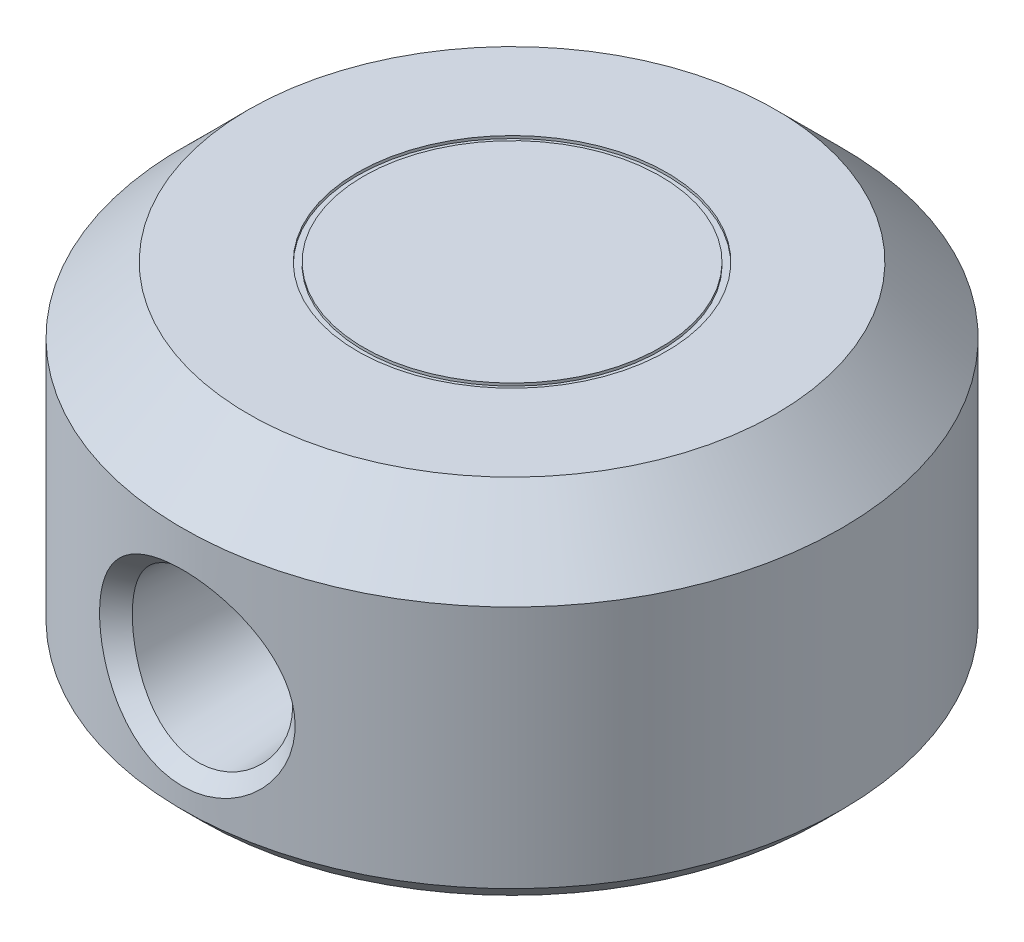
ISO-10303-21;
HEADER;
FILE_DESCRIPTION(('STEP AP214'),'2;1');
FILE_NAME('part.step','',(''),(''),'','','');
FILE_SCHEMA(('AUTOMOTIVE_DESIGN { 1 0 10303 214 1 1 1 1 }'));
ENDSEC;
DATA;
#1=APPLICATION_CONTEXT('core data for automotive mechanical design processes');
#2=APPLICATION_PROTOCOL_DEFINITION('international standard','automotive_design',2000,#1);
#3=PRODUCT_CONTEXT('',#1,'mechanical');
#4=PRODUCT('Part','Part','',(#3));
#5=PRODUCT_RELATED_PRODUCT_CATEGORY('part','',(#4));
#6=PRODUCT_DEFINITION_FORMATION('','',#4);
#7=PRODUCT_DEFINITION_CONTEXT('part definition',#1,'design');
#8=PRODUCT_DEFINITION('design','',#6,#7);
#9=PRODUCT_DEFINITION_SHAPE('','',#8);
#10=(LENGTH_UNIT() NAMED_UNIT(*) SI_UNIT(.MILLI.,.METRE.));
#11=(NAMED_UNIT(*) PLANE_ANGLE_UNIT() SI_UNIT($,.RADIAN.));
#12=(NAMED_UNIT(*) SI_UNIT($,.STERADIAN.) SOLID_ANGLE_UNIT());
#13=UNCERTAINTY_MEASURE_WITH_UNIT(LENGTH_MEASURE(1.E-05),#10,'distance_accuracy_value','');
#14=(GEOMETRIC_REPRESENTATION_CONTEXT(3) GLOBAL_UNCERTAINTY_ASSIGNED_CONTEXT((#13)) GLOBAL_UNIT_ASSIGNED_CONTEXT((#10,
#11,#12)) REPRESENTATION_CONTEXT('',''));
#15=CARTESIAN_POINT('',(0.,0.,0.));
#16=DIRECTION('',(0.,0.,1.));
#17=DIRECTION('',(1.,0.,0.));
#18=AXIS2_PLACEMENT_3D('',#15,#16,#17);
#19=CARTESIAN_POINT('',(0.,5.16142490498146,25.));
#20=DIRECTION('',(0.,0.,-1.));
#21=DIRECTION('',(-1.,0.,0.));
#22=AXIS2_PLACEMENT_3D('',#19,#20,#21);
#23=CYLINDRICAL_SURFACE('',#22,2.);
#24=CARTESIAN_POINT('',(0.,5.16142490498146,13.));
#25=DIRECTION('',(0.,0.,-1.));
#26=DIRECTION('',(-1.,0.,0.));
#27=AXIS2_PLACEMENT_3D('',#24,#25,#26);
#28=CIRCLE('',#27,2.);
#29=CARTESIAN_POINT('',(-2.,5.16142490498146,13.));
#30=VERTEX_POINT('',#29);
#31=EDGE_CURVE('E131',#30,#30,#28,.T.);
#32=ORIENTED_EDGE('',*,*,#31,.F.);
#33=EDGE_LOOP('',(#32));
#34=FACE_BOUND('',#33,.T.);
#35=CARTESIAN_POINT('',(-1.87322392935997,5.86216173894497,9.9998));
#36=CARTESIAN_POINT('',(-1.85746864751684,5.90427696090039,10.0254025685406));
#37=CARTESIAN_POINT('',(-1.84068704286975,5.94481280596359,10.052873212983));
#38=CARTESIAN_POINT('',(-1.80557430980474,6.02265798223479,10.1110725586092));
#39=CARTESIAN_POINT('',(-1.7872454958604,6.05997196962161,10.1417964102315));
#40=CARTESIAN_POINT('',(-1.74947699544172,6.13145859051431,10.2061280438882));
#41=CARTESIAN_POINT('',(-1.73003641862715,6.16562864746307,10.2397381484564));
#42=CARTESIAN_POINT('',(-1.69051226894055,6.23082832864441,10.3095379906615));
#43=CARTESIAN_POINT('',(-1.67042844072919,6.26185668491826,10.3457287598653));
#44=CARTESIAN_POINT('',(-1.61014417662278,6.34989593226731,10.4573875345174));
#45=CARTESIAN_POINT('',(-1.56965224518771,6.40232733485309,10.536368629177));
#46=CARTESIAN_POINT('',(-1.4921725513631,6.49447448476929,10.70304416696));
#47=CARTESIAN_POINT('',(-1.45518221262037,6.53419963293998,10.7907321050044));
#48=CARTESIAN_POINT('',(-1.40234723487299,6.58771639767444,10.9422552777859));
#49=CARTESIAN_POINT('',(-1.38364701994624,6.60571264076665,11.0035874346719));
#50=CARTESIAN_POINT('',(-1.35275130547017,6.63469165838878,11.1294166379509));
#51=CARTESIAN_POINT('',(-1.34054004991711,6.64569143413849,11.1939055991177));
#52=CARTESIAN_POINT('',(-1.32487297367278,6.65970322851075,11.325753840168));
#53=CARTESIAN_POINT('',(-1.32153150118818,6.66261094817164,11.3931393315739));
#54=CARTESIAN_POINT('',(-1.32522300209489,6.65935383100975,11.5274152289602));
#55=CARTESIAN_POINT('',(-1.33225208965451,6.65319239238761,11.5943058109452));
#56=CARTESIAN_POINT('',(-1.35381935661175,6.63361272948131,11.7151875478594));
#57=CARTESIAN_POINT('',(-1.36708797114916,6.62140749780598,11.7696195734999));
#58=CARTESIAN_POINT('',(-1.39874214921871,6.59111076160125,11.875277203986));
#59=CARTESIAN_POINT('',(-1.41713410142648,6.57301190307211,11.9264987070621));
#60=CARTESIAN_POINT('',(-1.46711488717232,6.52135277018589,12.0493072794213));
#61=CARTESIAN_POINT('',(-1.50077224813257,6.48455360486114,12.118687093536));
#62=CARTESIAN_POINT('',(-1.57096541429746,6.40041013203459,12.2491005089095));
#63=CARTESIAN_POINT('',(-1.60750592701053,6.35304833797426,12.3101199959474));
#64=CARTESIAN_POINT('',(-1.68069296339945,6.24746470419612,12.4247735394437));
#65=CARTESIAN_POINT('',(-1.71732592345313,6.18903771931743,12.4782278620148));
#66=CARTESIAN_POINT('',(-1.78684566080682,6.06274483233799,12.575556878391));
#67=CARTESIAN_POINT('',(-1.81973401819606,5.99488293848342,12.6194356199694));
#68=CARTESIAN_POINT('',(-1.88063767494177,5.84693535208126,12.6986140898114));
#69=CARTESIAN_POINT('',(-1.90830595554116,5.76639462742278,12.7333416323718));
#70=CARTESIAN_POINT('',(-1.95366891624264,5.59816058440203,12.7894595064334));
#71=CARTESIAN_POINT('',(-1.97137408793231,5.51047490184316,12.8108638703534));
#72=CARTESIAN_POINT('',(-1.99324075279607,5.34338773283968,12.83718001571));
#73=CARTESIAN_POINT('',(-1.99891053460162,5.26447047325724,12.8439313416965));
#74=CARTESIAN_POINT('',(-2.0008014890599,5.10637660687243,12.8461900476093));
#75=CARTESIAN_POINT('',(-1.99702704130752,5.02720013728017,12.8417026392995));
#76=CARTESIAN_POINT('',(-1.98107886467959,4.87766356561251,12.822558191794));
#77=CARTESIAN_POINT('',(-1.96961800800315,4.80711232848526,12.8087637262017));
#78=CARTESIAN_POINT('',(-1.9399077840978,4.66980126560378,12.7724803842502));
#79=CARTESIAN_POINT('',(-1.92165791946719,4.60304171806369,12.749990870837));
#80=CARTESIAN_POINT('',(-1.87853785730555,4.4713995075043,12.6957126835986));
#81=CARTESIAN_POINT('',(-1.85337893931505,4.4067835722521,12.6635103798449));
#82=CARTESIAN_POINT('',(-1.79861801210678,4.28422118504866,12.5911600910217));
#83=CARTESIAN_POINT('',(-1.76901296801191,4.22627933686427,12.5510066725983));
#84=CARTESIAN_POINT('',(-1.70308451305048,4.11046676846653,12.457558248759));
#85=CARTESIAN_POINT('',(-1.66639235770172,4.05364506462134,12.4032234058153));
#86=CARTESIAN_POINT('',(-1.59273166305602,3.95012936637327,12.2857175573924));
#87=CARTESIAN_POINT('',(-1.55576302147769,3.90343933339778,12.2225431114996));
#88=CARTESIAN_POINT('',(-1.49162711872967,3.82836770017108,12.0994784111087));
#89=CARTESIAN_POINT('',(-1.46388162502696,3.7982091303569,12.0409768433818));
#90=CARTESIAN_POINT('',(-1.41365771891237,3.74619375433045,11.9183176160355));
#91=CARTESIAN_POINT('',(-1.39116814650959,3.72431929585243,11.8541723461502));
#92=CARTESIAN_POINT('',(-1.35806301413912,3.69306211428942,11.733428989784));
#93=CARTESIAN_POINT('',(-1.34601902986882,3.68211529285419,11.6776366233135));
#94=CARTESIAN_POINT('',(-1.32908406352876,3.66687785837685,11.5641108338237));
#95=CARTESIAN_POINT('',(-1.32418487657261,3.66257960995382,11.5063797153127));
#96=CARTESIAN_POINT('',(-1.32202922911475,3.66067840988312,11.3907044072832));
#97=CARTESIAN_POINT('',(-1.32477003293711,3.66307306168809,11.3327603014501));
#98=CARTESIAN_POINT('',(-1.33709855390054,3.67406818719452,11.2182026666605));
#99=CARTESIAN_POINT('',(-1.34669508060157,3.682676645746,11.1615909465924));
#100=CARTESIAN_POINT('',(-1.37685558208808,3.71061236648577,11.0250947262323));
#101=CARTESIAN_POINT('',(-1.40043773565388,3.73305368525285,10.9465352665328));
#102=CARTESIAN_POINT('',(-1.45414297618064,3.78776669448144,10.7951265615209));
#103=CARTESIAN_POINT('',(-1.48429292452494,3.82007898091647,10.7223024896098));
#104=CARTESIAN_POINT('',(-1.53706559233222,3.88138945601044,10.6056599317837));
#105=CARTESIAN_POINT('',(-1.55889747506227,3.90797487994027,10.5601870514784));
#106=CARTESIAN_POINT('',(-1.6030698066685,3.96498454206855,10.4719724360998));
#107=CARTESIAN_POINT('',(-1.62541048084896,3.99541050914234,10.4292319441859));
#108=CARTESIAN_POINT('',(-1.69197874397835,4.09216991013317,10.3055931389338));
#109=CARTESIAN_POINT('',(-1.73597292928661,4.1642254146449,10.22881967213));
#110=CARTESIAN_POINT('',(-1.79434990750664,4.27726863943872,10.1298755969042));
#111=CARTESIAN_POINT('',(-1.81111347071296,4.31205044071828,10.1018525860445));
#112=CARTESIAN_POINT('',(-1.84328037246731,4.38432907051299,10.0486244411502));
#113=CARTESIAN_POINT('',(-1.85868280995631,4.42182766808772,10.0234211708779));
#114=CARTESIAN_POINT('',(-1.87322392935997,4.46068807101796,9.9998));
#115=B_SPLINE_CURVE_WITH_KNOTS('',3,(#35,#36,#37,#38,#39,#40,#41,#42,#43,#44,#45,#46,#47,#48,
#49,#50,#51,#52,#53,#54,#55,#56,#57,#58,#59,#60,#61,#62,#63,#64,#65,#66,#67,#68,#69,#70,#71,#72,
#73,#74,#75,#76,#77,#78,#79,#80,#81,#82,#83,#84,#85,#86,#87,#88,#89,#90,#91,#92,#93,#94,#95,#96,
#97,#98,#99,#100,#101,#102,#103,#104,#105,#106,#107,#108,#109,#110,#111,#112,#113,#114),
.UNSPECIFIED.,.F.,.F.,(4,2,2,2,2,2,2,2,2,2,2,2,2,2,2,2,2,2,2,2,2,2,2,2,2,2,2,2,2,2,2,2,2,2,2,2,
2,2,2,4),(0.,0.15509238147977,0.309956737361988,0.464946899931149,0.619999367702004,
0.92807713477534,1.23592643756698,1.43513426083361,1.63385614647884,1.8351277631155,
2.03632398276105,2.2076539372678,2.37919849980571,2.63415222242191,2.88953119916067,
3.15021478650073,3.41078796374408,3.68505796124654,3.95903859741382,4.19595148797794,
4.43275453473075,4.65017250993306,4.86760641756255,5.09606334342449,5.32467692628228,
5.5839112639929,5.84324677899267,6.05680520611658,6.2699059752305,6.44349665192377,
6.6168878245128,6.79021691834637,6.96376914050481,7.21746441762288,7.47221743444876,
7.64307742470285,7.81401460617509,8.15422054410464,8.2971993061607,8.44027202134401),.UNSPECIFIED.);
#116=CARTESIAN_POINT('',(-1.98296601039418,5.42189717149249,12.8248145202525));
#117=VERTEX_POINT('',#116);
#118=CARTESIAN_POINT('',(-1.87310080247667,4.46035901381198,10.000000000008));
#119=VERTEX_POINT('',#118);
#120=EDGE_CURVE('E166',#117,#119,#115,.T.);
#121=ORIENTED_EDGE('',*,*,#120,.F.);
#122=CARTESIAN_POINT('',(-1.99999999,5.16122490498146,12.8452502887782));
#123=CARTESIAN_POINT('',(-2.00000541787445,5.21679499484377,12.8403270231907));
#124=CARTESIAN_POINT('',(-1.99769352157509,5.27237180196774,12.8357683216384));
#125=CARTESIAN_POINT('',(-1.98844497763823,5.38319390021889,12.827393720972));
#126=CARTESIAN_POINT('',(-1.9815084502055,5.43843919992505,12.8235778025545));
#127=CARTESIAN_POINT('',(-1.95380977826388,5.60296762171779,12.8132767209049));
#128=CARTESIAN_POINT('',(-1.92615846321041,5.71124526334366,12.807920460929));
#129=CARTESIAN_POINT('',(-1.85318254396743,5.92178834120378,12.8000696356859));
#130=CARTESIAN_POINT('',(-1.80784782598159,6.024050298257,12.7975767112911));
#131=CARTESIAN_POINT('',(-1.70077841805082,6.21961753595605,12.7949845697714));
#132=CARTESIAN_POINT('',(-1.63904650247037,6.31292432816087,12.7948849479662));
#133=CARTESIAN_POINT('',(-1.50087011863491,6.48801418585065,12.7964042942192));
#134=CARTESIAN_POINT('',(-1.42441418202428,6.5697881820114,12.7980246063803));
#135=CARTESIAN_POINT('',(-1.25895160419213,6.71946484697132,12.8022003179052));
#136=CARTESIAN_POINT('',(-1.16994247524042,6.78736475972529,12.8047559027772));
#137=CARTESIAN_POINT('',(-0.981233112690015,6.90779051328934,12.810034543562));
#138=CARTESIAN_POINT('',(-0.881465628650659,6.96021095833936,12.8127586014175));
#139=CARTESIAN_POINT('',(-0.674549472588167,7.04758349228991,12.8176613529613));
#140=CARTESIAN_POINT('',(-0.567401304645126,7.08253677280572,12.8198400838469));
#141=CARTESIAN_POINT('',(-0.348606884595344,7.13401680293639,12.8231495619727));
#142=CARTESIAN_POINT('',(-0.2369551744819,7.15052045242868,12.8242789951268));
#143=CARTESIAN_POINT('',(-0.0124583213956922,7.16454589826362,12.8252347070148));
#144=CARTESIAN_POINT('',(0.100386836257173,7.16206746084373,12.8250609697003));
#145=CARTESIAN_POINT('',(0.323803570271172,7.13822657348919,12.8234502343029));
#146=CARTESIAN_POINT('',(0.434379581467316,7.11690545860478,12.8220160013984));
#147=CARTESIAN_POINT('',(0.650382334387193,7.05604715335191,12.8182073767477));
#148=CARTESIAN_POINT('',(0.75580902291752,7.01650977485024,12.8158329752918));
#149=CARTESIAN_POINT('',(0.95866254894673,6.92028348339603,12.8107010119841));
#150=CARTESIAN_POINT('',(1.05607980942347,6.86357440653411,12.8079430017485));
#151=CARTESIAN_POINT('',(1.2400306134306,6.73461919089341,12.8027795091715));
#152=CARTESIAN_POINT('',(1.32656438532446,6.66237337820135,12.8003740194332));
#153=CARTESIAN_POINT('',(1.48639541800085,6.50428675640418,12.7967253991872));
#154=CARTESIAN_POINT('',(1.55967749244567,6.41843055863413,12.7954835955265));
#155=CARTESIAN_POINT('',(1.6908008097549,6.23559723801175,12.7949541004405));
#156=CARTESIAN_POINT('',(1.74863875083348,6.13861774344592,12.7956668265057));
#157=CARTESIAN_POINT('',(1.84696078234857,5.93684844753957,12.7996804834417));
#158=CARTESIAN_POINT('',(1.88752335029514,5.83209656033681,12.8029695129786));
#159=CARTESIAN_POINT('',(1.95050747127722,5.61748280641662,12.8125195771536));
#160=CARTESIAN_POINT('',(1.97295375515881,5.50762812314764,12.8187765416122));
#161=CARTESIAN_POINT('',(1.99073433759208,5.35774616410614,12.8292908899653));
#162=CARTESIAN_POINT('',(1.99421551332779,5.31846486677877,12.8322279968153));
#163=CARTESIAN_POINT('',(1.99884715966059,5.23986426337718,12.8384670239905));
#164=CARTESIAN_POINT('',(2.00000175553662,5.20054514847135,12.8417682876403));
#165=CARTESIAN_POINT('',(1.99999999,5.16122490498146,12.8452502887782));
#166=B_SPLINE_CURVE_WITH_KNOTS('',3,(#122,#123,#124,#125,#126,#127,#128,#129,#130,#131,#132,
#133,#134,#135,#136,#137,#138,#139,#140,#141,#142,#143,#144,#145,#146,#147,#148,#149,#150,#151,
#152,#153,#154,#155,#156,#157,#158,#159,#160,#161,#162,#163,#164,#165),.UNSPECIFIED.,.F.,.F.,(4,
2,2,2,2,2,2,2,2,2,2,2,2,2,2,2,2,2,2,2,2,4),(0.,0.167262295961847,0.334520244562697,
0.668435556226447,1.00254212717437,1.33659220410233,1.67090352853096,2.00528119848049,
2.34188567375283,2.67846718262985,3.0154696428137,3.35247625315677,3.68874540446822,
4.02501802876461,4.36168706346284,4.69834903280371,5.03539440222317,5.37251177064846,
5.70808093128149,6.04319122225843,6.16177209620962,6.28014252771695),.UNSPECIFIED.);
#167=CARTESIAN_POINT('',(1.98296601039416,5.42189717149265,12.8248145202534));
#168=VERTEX_POINT('',#167);
#169=EDGE_CURVE('E77',#117,#168,#166,.T.);
#170=ORIENTED_EDGE('',*,*,#169,.T.);
#171=CARTESIAN_POINT('',(1.87322392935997,4.46068807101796,9.9998));
#172=CARTESIAN_POINT('',(1.85746864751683,4.41857284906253,10.0254025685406));
#173=CARTESIAN_POINT('',(1.84068704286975,4.37803700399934,10.052873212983));
#174=CARTESIAN_POINT('',(1.80557430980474,4.30019182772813,10.1110725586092));
#175=CARTESIAN_POINT('',(1.7872454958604,4.26287784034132,10.1417964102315));
#176=CARTESIAN_POINT('',(1.74947699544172,4.19139121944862,10.2061280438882));
#177=CARTESIAN_POINT('',(1.73003641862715,4.15722116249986,10.2397381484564));
#178=CARTESIAN_POINT('',(1.69051226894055,4.09202148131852,10.3095379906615));
#179=CARTESIAN_POINT('',(1.67042844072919,4.06099312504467,10.3457287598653));
#180=CARTESIAN_POINT('',(1.61014417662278,3.97295387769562,10.4573875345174));
#181=CARTESIAN_POINT('',(1.5696522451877,3.92052247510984,10.536368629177));
#182=CARTESIAN_POINT('',(1.4921725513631,3.82837532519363,10.70304416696));
#183=CARTESIAN_POINT('',(1.45518221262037,3.78865017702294,10.7907321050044));
#184=CARTESIAN_POINT('',(1.40234723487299,3.73513341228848,10.9422552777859));
#185=CARTESIAN_POINT('',(1.38364701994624,3.71713716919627,11.0035874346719));
#186=CARTESIAN_POINT('',(1.35275130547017,3.68815815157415,11.1294166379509));
#187=CARTESIAN_POINT('',(1.34054004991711,3.67715837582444,11.1939055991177));
#188=CARTESIAN_POINT('',(1.32487297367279,3.66314658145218,11.325753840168));
#189=CARTESIAN_POINT('',(1.32153150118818,3.66023886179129,11.3931393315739));
#190=CARTESIAN_POINT('',(1.32522300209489,3.66349597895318,11.5274152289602));
#191=CARTESIAN_POINT('',(1.33225208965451,3.66965741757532,11.5943058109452));
#192=CARTESIAN_POINT('',(1.35381935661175,3.68923708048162,11.7151875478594));
#193=CARTESIAN_POINT('',(1.36708797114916,3.70144231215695,11.7696195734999));
#194=CARTESIAN_POINT('',(1.39874214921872,3.73173904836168,11.875277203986));
#195=CARTESIAN_POINT('',(1.41713410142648,3.74983790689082,11.9264987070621));
#196=CARTESIAN_POINT('',(1.46711488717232,3.80149703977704,12.0493072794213));
#197=CARTESIAN_POINT('',(1.50077224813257,3.83829620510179,12.118687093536));
#198=CARTESIAN_POINT('',(1.57096541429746,3.92243967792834,12.2491005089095));
#199=CARTESIAN_POINT('',(1.60750592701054,3.96980147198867,12.3101199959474));
#200=CARTESIAN_POINT('',(1.68069296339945,4.07538510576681,12.4247735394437));
#201=CARTESIAN_POINT('',(1.71732592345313,4.1338120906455,12.4782278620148));
#202=CARTESIAN_POINT('',(1.78684566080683,4.26010497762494,12.575556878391));
#203=CARTESIAN_POINT('',(1.81973401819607,4.32796687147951,12.6194356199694));
#204=CARTESIAN_POINT('',(1.88063767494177,4.47591445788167,12.6986140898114));
#205=CARTESIAN_POINT('',(1.90830595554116,4.55645518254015,12.7333416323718));
#206=CARTESIAN_POINT('',(1.95366891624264,4.7246892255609,12.7894595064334));
#207=CARTESIAN_POINT('',(1.97137408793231,4.81237490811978,12.8108638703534));
#208=CARTESIAN_POINT('',(1.99324075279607,4.97946207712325,12.83718001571));
#209=CARTESIAN_POINT('',(1.99891053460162,5.0583793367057,12.8439313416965));
#210=CARTESIAN_POINT('',(2.0008014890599,5.2164732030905,12.8461900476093));
#211=CARTESIAN_POINT('',(1.99702704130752,5.29564967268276,12.8417026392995));
#212=CARTESIAN_POINT('',(1.98107886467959,5.44518624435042,12.822558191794));
#213=CARTESIAN_POINT('',(1.96961800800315,5.51573748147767,12.8087637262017));
#214=CARTESIAN_POINT('',(1.9399077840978,5.65304854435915,12.7724803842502));
#215=CARTESIAN_POINT('',(1.92165791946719,5.71980809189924,12.749990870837));
#216=CARTESIAN_POINT('',(1.87853785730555,5.85145030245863,12.6957126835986));
#217=CARTESIAN_POINT('',(1.85337893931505,5.91606623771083,12.6635103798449));
#218=CARTESIAN_POINT('',(1.79861801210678,6.03862862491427,12.5911600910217));
#219=CARTESIAN_POINT('',(1.76901296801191,6.09657047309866,12.5510066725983));
#220=CARTESIAN_POINT('',(1.70308451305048,6.2123830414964,12.457558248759));
#221=CARTESIAN_POINT('',(1.66639235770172,6.26920474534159,12.4032234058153));
#222=CARTESIAN_POINT('',(1.59273166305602,6.37272044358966,12.2857175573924));
#223=CARTESIAN_POINT('',(1.55576302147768,6.41941047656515,12.2225431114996));
#224=CARTESIAN_POINT('',(1.49162711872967,6.49448210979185,12.0994784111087));
#225=CARTESIAN_POINT('',(1.46388162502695,6.52464067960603,12.0409768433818));
#226=CARTESIAN_POINT('',(1.41365771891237,6.57665605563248,11.9183176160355));
#227=CARTESIAN_POINT('',(1.39116814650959,6.5985305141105,11.8541723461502));
#228=CARTESIAN_POINT('',(1.35806301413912,6.6297876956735,11.733428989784));
#229=CARTESIAN_POINT('',(1.34601902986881,6.64073451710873,11.6776366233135));
#230=CARTESIAN_POINT('',(1.32908406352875,6.65597195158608,11.5641108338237));
#231=CARTESIAN_POINT('',(1.32418487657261,6.66027020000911,11.5063797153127));
#232=CARTESIAN_POINT('',(1.32202922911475,6.66217140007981,11.3907044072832));
#233=CARTESIAN_POINT('',(1.32477003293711,6.65977674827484,11.3327603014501));
#234=CARTESIAN_POINT('',(1.33709855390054,6.6487816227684,11.2182026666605));
#235=CARTESIAN_POINT('',(1.34669508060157,6.64017316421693,11.1615909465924));
#236=CARTESIAN_POINT('',(1.37685558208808,6.61223744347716,11.0250947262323));
#237=CARTESIAN_POINT('',(1.40043773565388,6.58979612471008,10.9465352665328));
#238=CARTESIAN_POINT('',(1.45414297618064,6.53508311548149,10.7951265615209));
#239=CARTESIAN_POINT('',(1.48429292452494,6.50277082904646,10.7223024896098));
#240=CARTESIAN_POINT('',(1.53706559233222,6.44146035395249,10.6056599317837));
#241=CARTESIAN_POINT('',(1.55889747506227,6.41487493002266,10.5601870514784));
#242=CARTESIAN_POINT('',(1.6030698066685,6.35786526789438,10.4719724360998));
#243=CARTESIAN_POINT('',(1.62541048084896,6.32743930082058,10.4292319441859));
#244=CARTESIAN_POINT('',(1.69197874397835,6.23067989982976,10.3055931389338));
#245=CARTESIAN_POINT('',(1.73597292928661,6.15862439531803,10.22881967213));
#246=CARTESIAN_POINT('',(1.79434990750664,6.04558117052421,10.1298755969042));
#247=CARTESIAN_POINT('',(1.81111347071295,6.01079936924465,10.1018525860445));
#248=CARTESIAN_POINT('',(1.84328037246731,5.93852073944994,10.0486244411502));
#249=CARTESIAN_POINT('',(1.85868280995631,5.90102214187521,10.0234211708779));
#250=CARTESIAN_POINT('',(1.87322392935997,5.86216173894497,9.9998));
#251=B_SPLINE_CURVE_WITH_KNOTS('',3,(#171,#172,#173,#174,#175,#176,#177,#178,#179,#180,#181,
#182,#183,#184,#185,#186,#187,#188,#189,#190,#191,#192,#193,#194,#195,#196,#197,#198,#199,#200,
#201,#202,#203,#204,#205,#206,#207,#208,#209,#210,#211,#212,#213,#214,#215,#216,#217,#218,#219,
#220,#221,#222,#223,#224,#225,#226,#227,#228,#229,#230,#231,#232,#233,#234,#235,#236,#237,#238,
#239,#240,#241,#242,#243,#244,#245,#246,#247,#248,#249,#250),.UNSPECIFIED.,.F.,.F.,(4,2,2,2,2,2,
2,2,2,2,2,2,2,2,2,2,2,2,2,2,2,2,2,2,2,2,2,2,2,2,2,2,2,2,2,2,2,2,2,4),(0.,0.15509238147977,
0.309956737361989,0.46494689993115,0.619999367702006,0.928077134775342,1.23592643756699,
1.43513426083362,1.63385614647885,1.8351277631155,2.03632398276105,2.2076539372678,
2.37919849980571,2.63415222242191,2.88953119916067,3.15021478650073,3.41078796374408,
3.68505796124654,3.95903859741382,4.19595148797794,4.43275453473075,4.65017250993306,
4.86760641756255,5.09606334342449,5.32467692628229,5.58391126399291,5.84324677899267,
6.05680520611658,6.2699059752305,6.44349665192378,6.6168878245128,6.79021691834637,
6.96376914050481,7.21746441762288,7.47221743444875,7.64307742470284,7.81401460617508,
8.15422054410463,8.2971993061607,8.440272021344),.UNSPECIFIED.);
#252=CARTESIAN_POINT('',(1.87310080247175,4.46035901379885,10.0000000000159));
#253=VERTEX_POINT('',#252);
#254=EDGE_CURVE('E113',#253,#168,#251,.T.);
#255=ORIENTED_EDGE('',*,*,#254,.F.);
#256=CARTESIAN_POINT('',(0.,5.16142490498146,10.));
#257=DIRECTION('',(0.,0.,1.));
#258=DIRECTION('',(1.,0.,0.));
#259=AXIS2_PLACEMENT_3D('',#256,#257,#258);
#260=CIRCLE('',#259,2.);
#261=EDGE_CURVE('E257',#119,#253,#260,.T.);
#262=ORIENTED_EDGE('',*,*,#261,.F.);
#263=EDGE_LOOP('',(#121,#170,#255,#262));
#264=FACE_BOUND('',#263,.T.);
#265=ADVANCED_FACE('F60',(#34,#264),#23,.F.);
#266=CARTESIAN_POINT('',(0.,5.16142490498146,10.));
#267=DIRECTION('',(0.,0.,1.));
#268=DIRECTION('',(1.,0.,0.));
#269=AXIS2_PLACEMENT_3D('',#266,#267,#268);
#270=PLANE('',#269);
#271=CARTESIAN_POINT('',(0.,5.16142490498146,10.));
#272=CARTESIAN_POINT('',(0.0062166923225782,5.15901720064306,10.));
#273=CARTESIAN_POINT('',(0.0124333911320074,5.15660948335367,10.));
#274=CARTESIAN_POINT('',(0.485590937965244,4.97335742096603,10.));
#275=CARTESIAN_POINT('',(0.95261262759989,4.79256197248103,10.));
#276=CARTESIAN_POINT('',(1.65780765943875,4.5353463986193,10.));
#277=CARTESIAN_POINT('',(1.89342385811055,4.452009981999,10.));
#278=CARTESIAN_POINT('',(2.36717332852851,4.2924586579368,10.));
#279=CARTESIAN_POINT('',(2.60530741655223,4.21624614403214,10.));
#280=CARTESIAN_POINT('',(3.08623489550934,4.07340284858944,10.));
#281=CARTESIAN_POINT('',(3.3290489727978,4.00684085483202,10.));
#282=CARTESIAN_POINT('',(3.8178883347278,3.88752828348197,10.));
#283=CARTESIAN_POINT('',(4.06390999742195,3.83476334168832,10.));
#284=CARTESIAN_POINT('',(4.4366750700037,3.76905912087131,10.));
#285=CARTESIAN_POINT('',(4.56222660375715,3.7493301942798,10.));
#286=CARTESIAN_POINT('',(4.81403779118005,3.71525378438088,10.));
#287=CARTESIAN_POINT('',(4.94029726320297,3.70090497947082,10.));
#288=CARTESIAN_POINT('',(5.19385568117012,3.67834935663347,10.));
#289=CARTESIAN_POINT('',(5.32115674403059,3.67016542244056,10.));
#290=CARTESIAN_POINT('',(5.57612107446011,3.66105137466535,10.));
#291=CARTESIAN_POINT('',(5.70378456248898,3.66012766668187,10.));
#292=CARTESIAN_POINT('',(5.83140949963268,3.66335489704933,10.));
#293=B_SPLINE_CURVE_WITH_KNOTS('',3,(#271,#272,#273,#274,#275,#276,#277,#278,#279,#280,#281,
#282,#283,#284,#285,#286,#287,#288,#289,#290,#291,#292),.UNSPECIFIED.,.F.,.F.,(4,2,2,2,2,2,2,2,
2,2,4),(0.,0.0200000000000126,1.52221129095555,2.27189480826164,3.02182931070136,
3.77687099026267,4.53112343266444,4.91230543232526,5.29339373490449,5.67588974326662,
6.05872318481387),.UNSPECIFIED.);
#294=CARTESIAN_POINT('',(0.,5.16142490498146,10.));
#295=VERTEX_POINT('',#294);
#296=EDGE_CURVE('E128',#295,#253,#293,.T.);
#297=ORIENTED_EDGE('',*,*,#296,.F.);
#298=CARTESIAN_POINT('',(0.,5.16142490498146,10.));
#299=CARTESIAN_POINT('',(-0.00621669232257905,5.15901720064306,10.));
#300=CARTESIAN_POINT('',(-0.0124333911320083,5.15660948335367,10.));
#301=CARTESIAN_POINT('',(-0.485590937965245,4.97335742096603,10.));
#302=CARTESIAN_POINT('',(-0.952612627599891,4.79256197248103,10.));
#303=CARTESIAN_POINT('',(-1.65780765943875,4.5353463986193,10.));
#304=CARTESIAN_POINT('',(-1.89342385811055,4.452009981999,10.));
#305=CARTESIAN_POINT('',(-2.36717332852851,4.2924586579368,10.));
#306=CARTESIAN_POINT('',(-2.60530741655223,4.21624614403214,10.));
#307=CARTESIAN_POINT('',(-3.08623489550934,4.07340284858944,10.));
#308=CARTESIAN_POINT('',(-3.3290489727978,4.00684085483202,10.));
#309=CARTESIAN_POINT('',(-3.8178883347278,3.88752828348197,10.));
#310=CARTESIAN_POINT('',(-4.06390999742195,3.83476334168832,10.));
#311=CARTESIAN_POINT('',(-4.4366750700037,3.76905912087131,10.));
#312=CARTESIAN_POINT('',(-4.56222660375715,3.7493301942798,10.));
#313=CARTESIAN_POINT('',(-4.81403779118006,3.71525378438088,10.));
#314=CARTESIAN_POINT('',(-4.94029726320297,3.70090497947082,10.));
#315=CARTESIAN_POINT('',(-5.19385568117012,3.67834935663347,10.));
#316=CARTESIAN_POINT('',(-5.32115674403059,3.67016542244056,10.));
#317=CARTESIAN_POINT('',(-5.57612107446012,3.66105137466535,10.));
#318=CARTESIAN_POINT('',(-5.70378456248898,3.66012766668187,10.));
#319=CARTESIAN_POINT('',(-5.83140949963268,3.66335489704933,10.));
#320=B_SPLINE_CURVE_WITH_KNOTS('',3,(#298,#299,#300,#301,#302,#303,#304,#305,#306,#307,#308,
#309,#310,#311,#312,#313,#314,#315,#316,#317,#318,#319),.UNSPECIFIED.,.F.,.F.,(4,2,2,2,2,2,2,2,
2,2,4),(0.,0.0200000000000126,1.52221129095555,2.27189480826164,3.02182931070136,
3.77687099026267,4.53112343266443,4.91230543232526,5.29339373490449,5.67588974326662,
6.05872318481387),.UNSPECIFIED.);
#321=EDGE_CURVE('E126',#119,#295,#320,.F.);
#322=ORIENTED_EDGE('',*,*,#321,.F.);
#323=ORIENTED_EDGE('',*,*,#261,.T.);
#324=EDGE_LOOP('',(#297,#322,#323));
#325=FACE_BOUND('',#324,.T.);
#326=ADVANCED_FACE('F294',(#325),#270,.T.);
#327=CARTESIAN_POINT('',(0.,0.,0.));
#328=DIRECTION('',(0.,-1.,0.));
#329=DIRECTION('',(1.,0.,0.));
#330=AXIS2_PLACEMENT_3D('',#327,#328,#329);
#331=CYLINDRICAL_SURFACE('',#330,25.);
#332=CARTESIAN_POINT('',(0.,-3.49999999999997,0.));
#333=DIRECTION('',(0.,-1.,0.));
#334=DIRECTION('',(1.,0.,0.));
#335=AXIS2_PLACEMENT_3D('',#332,#333,#334);
#336=CIRCLE('',#335,25.);
#337=CARTESIAN_POINT('',(25.,-3.49999999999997,0.));
#338=VERTEX_POINT('',#337);
#339=EDGE_CURVE('E284',#338,#338,#336,.F.);
#340=ORIENTED_EDGE('',*,*,#339,.T.);
#341=EDGE_LOOP('',(#340));
#342=FACE_BOUND('',#341,.T.);
#343=CARTESIAN_POINT('',(-5.39779595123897,0.281655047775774,24.4103215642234));
#344=CARTESIAN_POINT('',(-5.31486845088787,0.197177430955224,24.4286591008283));
#345=CARTESIAN_POINT('',(-5.22999750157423,0.114859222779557,24.4469833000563));
#346=CARTESIAN_POINT('',(-5.0564103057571,-0.0455094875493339,24.4834756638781));
#347=CARTESIAN_POINT('',(-4.96769224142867,-0.123561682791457,24.5016443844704));
#348=CARTESIAN_POINT('',(-4.69576788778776,-0.35136551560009,24.5557309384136));
#349=CARTESIAN_POINT('',(-4.50676862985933,-0.494800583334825,24.591236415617));
#350=CARTESIAN_POINT('',(-4.21160529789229,-0.697081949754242,24.642897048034));
#351=CARTESIAN_POINT('',(-4.11118765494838,-0.762405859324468,24.6598635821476));
#352=CARTESIAN_POINT('',(-3.95765295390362,-0.857068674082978,24.6848066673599));
#353=CARTESIAN_POINT('',(-3.90593850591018,-0.888096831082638,24.6930441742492));
#354=CARTESIAN_POINT('',(-3.80154132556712,-0.949024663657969,24.7093318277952));
#355=CARTESIAN_POINT('',(-3.74878133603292,-0.978964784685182,24.7173930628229));
#356=CARTESIAN_POINT('',(-3.58975784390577,-1.06667044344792,24.7411622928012));
#357=CARTESIAN_POINT('',(-3.48258739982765,-1.12243659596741,24.7564849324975));
#358=CARTESIAN_POINT('',(-3.26585630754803,-1.22868733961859,24.7860070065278));
#359=CARTESIAN_POINT('',(-3.15631301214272,-1.27916386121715,24.8002043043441));
#360=CARTESIAN_POINT('',(-2.82416031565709,-1.42270587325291,24.8409719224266));
#361=CARTESIAN_POINT('',(-2.598036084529,-1.5079023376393,24.865719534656));
#362=CARTESIAN_POINT('',(-2.25170243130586,-1.61981764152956,24.8986602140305));
#363=CARTESIAN_POINT('',(-2.13506483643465,-1.65447181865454,24.9089437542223));
#364=CARTESIAN_POINT('',(-1.89935764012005,-1.71839323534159,24.9280248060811));
#365=CARTESIAN_POINT('',(-1.78035104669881,-1.74764614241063,24.9368179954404));
#366=CARTESIAN_POINT('',(-1.5997805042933,-1.78743375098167,24.9488346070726));
#367=CARTESIAN_POINT('',(-1.53932344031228,-1.79999273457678,24.9526381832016));
#368=CARTESIAN_POINT('',(-1.41849068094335,-1.82358358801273,24.9597984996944));
#369=CARTESIAN_POINT('',(-1.35799032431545,-1.83464339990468,24.9631636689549));
#370=CARTESIAN_POINT('',(-1.17644689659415,-1.86559135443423,24.9725979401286));
#371=CARTESIAN_POINT('',(-1.05519251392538,-1.88328648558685,24.9780171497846));
#372=CARTESIAN_POINT('',(-0.690992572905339,-1.92763263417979,24.9916293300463));
#373=CARTESIAN_POINT('',(-0.447435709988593,-1.9456014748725,24.9971892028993));
#374=CARTESIAN_POINT('',(0.0410784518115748,-1.95844608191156,25.0011595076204));
#375=CARTESIAN_POINT('',(0.286085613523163,-1.95330973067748,24.9995661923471));
#376=CARTESIAN_POINT('',(0.593184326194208,-1.93214831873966,24.9930383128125));
#377=CARTESIAN_POINT('',(0.65467898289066,-1.92716480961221,24.9915020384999));
#378=CARTESIAN_POINT('',(0.777693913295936,-1.91571511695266,24.9879768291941));
#379=CARTESIAN_POINT('',(0.839332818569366,-1.90923012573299,24.9859821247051));
#380=CARTESIAN_POINT('',(1.0234091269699,-1.88761967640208,24.9793452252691));
#381=CARTESIAN_POINT('',(1.14510173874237,-1.87035191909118,24.9740539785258));
#382=CARTESIAN_POINT('',(1.38670341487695,-1.83019693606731,24.9618045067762));
#383=CARTESIAN_POINT('',(1.50657609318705,-1.80731536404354,24.9548480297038));
#384=CARTESIAN_POINT('',(1.74449910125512,-1.75603528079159,24.9393451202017));
#385=CARTESIAN_POINT('',(1.86254933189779,-1.7276364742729,24.9307985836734));
#386=CARTESIAN_POINT('',(2.21399756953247,-1.63423766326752,24.9028806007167));
#387=CARTESIAN_POINT('',(2.44475866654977,-1.56102509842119,24.8812221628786));
#388=CARTESIAN_POINT('',(2.7853336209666,-1.43483606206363,24.844617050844));
#389=CARTESIAN_POINT('',(2.89805449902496,-1.38997932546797,24.8317119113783));
#390=CARTESIAN_POINT('',(3.06562232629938,-1.31858873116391,24.811391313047));
#391=CARTESIAN_POINT('',(3.1212797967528,-1.29408039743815,24.8044498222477));
#392=CARTESIAN_POINT('',(3.23212817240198,-1.24366286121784,24.7902495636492));
#393=CARTESIAN_POINT('',(3.28731024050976,-1.21775370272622,24.7829910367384));
#394=CARTESIAN_POINT('',(3.45121940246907,-1.13836088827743,24.7608807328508));
#395=CARTESIAN_POINT('',(3.55861786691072,-1.0830891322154,24.7456587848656));
#396=CARTESIAN_POINT('',(3.76976315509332,-0.967952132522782,24.7143738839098));
#397=CARTESIAN_POINT('',(3.87351045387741,-0.908088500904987,24.6983112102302));
#398=CARTESIAN_POINT('',(4.17938461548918,-0.721712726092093,24.6490449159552));
#399=CARTESIAN_POINT('',(4.37615517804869,-0.588430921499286,24.6147619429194));
#400=CARTESIAN_POINT('',(4.6607716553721,-0.375034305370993,24.5618916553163));
#401=CARTESIAN_POINT('',(4.75388411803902,-0.301652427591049,24.5440268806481));
#402=CARTESIAN_POINT('',(4.93657885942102,-0.150348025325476,24.5079346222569));
#403=CARTESIAN_POINT('',(5.02619975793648,-0.0723863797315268,24.4896984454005));
#404=CARTESIAN_POINT('',(5.2017202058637,0.0879966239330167,24.4530196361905));
#405=CARTESIAN_POINT('',(5.28798743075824,0.170796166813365,24.4344952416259));
#406=CARTESIAN_POINT('',(5.45542298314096,0.339628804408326,24.3976574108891));
#407=CARTESIAN_POINT('',(5.53664551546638,0.425671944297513,24.3793374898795));
#408=CARTESIAN_POINT('',(5.69425843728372,0.601037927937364,24.3430064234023));
#409=CARTESIAN_POINT('',(5.77063973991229,0.690348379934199,24.3249975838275));
#410=CARTESIAN_POINT('',(5.91861694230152,0.872201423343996,24.2894167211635));
#411=CARTESIAN_POINT('',(5.99021275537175,0.964744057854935,24.2718446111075));
#412=CARTESIAN_POINT('',(6.12864607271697,1.15306361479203,24.2372603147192));
#413=CARTESIAN_POINT('',(6.19548356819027,1.2488405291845,24.2202480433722));
#414=CARTESIAN_POINT('',(6.32439070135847,1.44365522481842,24.1869079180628));
#415=CARTESIAN_POINT('',(6.38646040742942,1.54269294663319,24.1705799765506));
#416=CARTESIAN_POINT('',(6.50578523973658,1.74408086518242,24.1387359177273));
#417=CARTESIAN_POINT('',(6.56303835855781,1.84643294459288,24.1232201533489));
#418=CARTESIAN_POINT('',(6.67265281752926,2.05451976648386,24.0931305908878));
#419=CARTESIAN_POINT('',(6.72506184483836,2.16041795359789,24.0785419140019));
#420=CARTESIAN_POINT('',(6.82373736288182,2.3731588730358,24.0507635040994));
#421=CARTESIAN_POINT('',(6.87025761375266,2.48046810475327,24.0375045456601));
#422=CARTESIAN_POINT('',(6.95759173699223,2.69665857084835,24.0123714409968));
#423=CARTESIAN_POINT('',(6.99843136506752,2.80558800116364,24.0004901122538));
#424=CARTESIAN_POINT('',(7.11253143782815,3.13487115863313,23.9670229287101));
#425=CARTESIAN_POINT('',(7.17739207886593,3.3577144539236,23.9476131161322));
#426=CARTESIAN_POINT('',(7.28453064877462,3.81014234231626,23.9152408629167));
#427=CARTESIAN_POINT('',(7.32679952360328,4.0396347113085,23.9022811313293));
#428=CARTESIAN_POINT('',(7.38794183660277,4.50601631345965,23.8834530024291));
#429=CARTESIAN_POINT('',(7.40626206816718,4.73885316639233,23.8777579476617));
#430=CARTESIAN_POINT('',(7.41920811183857,5.20321437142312,23.8737387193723));
#431=CARTESIAN_POINT('',(7.41384500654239,5.43484998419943,23.875410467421));
#432=CARTESIAN_POINT('',(7.37962704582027,5.8970271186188,23.8860089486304));
#433=CARTESIAN_POINT('',(7.35074189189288,6.12764061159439,23.8949451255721));
#434=CARTESIAN_POINT('',(7.2895138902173,6.47251969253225,23.9136665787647));
#435=CARTESIAN_POINT('',(7.26604304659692,6.58751961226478,23.9208148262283));
#436=CARTESIAN_POINT('',(7.21310911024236,6.81666338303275,23.9368298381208));
#437=CARTESIAN_POINT('',(7.18384955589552,6.92994267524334,23.9456347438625));
#438=CARTESIAN_POINT('',(7.11977901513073,7.15438876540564,23.9647629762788));
#439=CARTESIAN_POINT('',(7.08498399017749,7.26548682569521,23.9750814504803));
#440=CARTESIAN_POINT('',(7.00995992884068,7.48547626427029,23.9971246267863));
#441=CARTESIAN_POINT('',(6.96973061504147,7.59436752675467,24.0088494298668));
#442=CARTESIAN_POINT('',(6.84095707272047,7.9177720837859,24.0459828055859));
#443=CARTESIAN_POINT('',(6.74434073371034,8.12903128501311,24.0733523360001));
#444=CARTESIAN_POINT('',(6.5831819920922,8.43939061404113,24.1177282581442));
#445=CARTESIAN_POINT('',(6.52673642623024,8.54177806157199,24.133078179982));
#446=CARTESIAN_POINT('',(6.40837513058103,8.74430425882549,24.1647777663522));
#447=CARTESIAN_POINT('',(6.3463524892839,8.84460660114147,24.1811553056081));
#448=CARTESIAN_POINT('',(6.21703628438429,9.04243342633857,24.2147253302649));
#449=CARTESIAN_POINT('',(6.15019431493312,9.13929036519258,24.2318011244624));
#450=CARTESIAN_POINT('',(6.01198695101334,9.32934793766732,24.2664601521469));
#451=CARTESIAN_POINT('',(5.9406611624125,9.42248799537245,24.2840331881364));
#452=CARTESIAN_POINT('',(5.72008952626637,9.69633856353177,24.3372852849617));
#453=CARTESIAN_POINT('',(5.56426428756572,9.87149170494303,24.3734979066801));
#454=CARTESIAN_POINT('',(5.23502402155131,10.2071309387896,24.4463276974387));
#455=CARTESIAN_POINT('',(5.06155720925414,10.3676417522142,24.4829549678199));
#456=CARTESIAN_POINT('',(4.78788399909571,10.597111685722,24.5374183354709));
#457=CARTESIAN_POINT('',(4.69420640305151,10.6718442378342,24.5555270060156));
#458=CARTESIAN_POINT('',(4.50282590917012,10.8169959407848,24.5913406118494));
#459=CARTESIAN_POINT('',(4.40565464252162,10.8870213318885,24.6089469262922));
#460=CARTESIAN_POINT('',(4.20804121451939,11.0222962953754,24.6435072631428));
#461=CARTESIAN_POINT('',(4.10765527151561,11.0875037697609,24.66045090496));
#462=CARTESIAN_POINT('',(3.90372951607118,11.2130928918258,24.6935531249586));
#463=CARTESIAN_POINT('',(3.80018965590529,11.2734744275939,24.7097118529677));
#464=CARTESIAN_POINT('',(3.48481091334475,11.4473753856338,24.7568431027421));
#465=CARTESIAN_POINT('',(3.26821662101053,11.553660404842,24.7864706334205));
#466=CARTESIAN_POINT('',(2.98930090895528,11.6741873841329,24.820702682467));
#467=CARTESIAN_POINT('',(2.93310725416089,11.6976667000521,24.8274067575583));
#468=CARTESIAN_POINT('',(2.81987413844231,11.7433860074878,24.8405225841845));
#469=CARTESIAN_POINT('',(2.76284269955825,11.7656163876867,24.8469317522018));
#470=CARTESIAN_POINT('',(2.59138375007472,11.8300754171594,24.8655972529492));
#471=CARTESIAN_POINT('',(2.47632569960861,11.8701951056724,24.8773258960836));
#472=CARTESIAN_POINT('',(2.24470612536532,11.9448085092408,24.8992937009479));
#473=CARTESIAN_POINT('',(2.1281473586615,11.9793030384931,24.9095330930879));
#474=CARTESIAN_POINT('',(1.8935384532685,12.0427098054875,24.9284648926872));
#475=CARTESIAN_POINT('',(1.77548830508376,12.0716219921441,24.9371573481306));
#476=CARTESIAN_POINT('',(1.5378927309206,12.1238640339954,24.9529369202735));
#477=CARTESIAN_POINT('',(1.41834731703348,12.1471939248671,24.9600240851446));
#478=CARTESIAN_POINT('',(1.17774685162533,12.1882296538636,24.9725333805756));
#479=CARTESIAN_POINT('',(1.05669183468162,12.2059356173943,24.9779555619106));
#480=CARTESIAN_POINT('',(0.813046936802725,12.23563866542,24.9870729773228));
#481=CARTESIAN_POINT('',(0.6905286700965,12.2476299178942,24.9907663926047));
#482=CARTESIAN_POINT('',(0.50535776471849,12.2612550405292,24.9949681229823));
#483=CARTESIAN_POINT('',(0.443510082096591,12.2650574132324,24.996141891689));
#484=CARTESIAN_POINT('',(0.320159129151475,12.2711577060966,24.9980258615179));
#485=CARTESIAN_POINT('',(0.258525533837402,12.2734687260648,24.99874011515));
#486=CARTESIAN_POINT('',(-0.0490135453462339,12.2812907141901,25.0011578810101));
#487=CARTESIAN_POINT('',(-0.293812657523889,12.2758136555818,24.9994592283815));
#488=CARTESIAN_POINT('',(-0.780690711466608,12.2418863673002,24.9889938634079));
#489=CARTESIAN_POINT('',(-1.02283082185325,12.2134495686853,24.980231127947));
#490=CARTESIAN_POINT('',(-1.38405750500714,12.153522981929,24.9619495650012));
#491=CARTESIAN_POINT('',(-1.50415679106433,12.1306585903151,24.9549975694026));
#492=CARTESIAN_POINT('',(-1.74364286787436,12.0790972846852,24.9394089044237));
#493=CARTESIAN_POINT('',(-1.86319520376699,12.050356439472,24.930758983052));
#494=CARTESIAN_POINT('',(-2.10105570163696,11.9870595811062,24.9118404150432));
#495=CARTESIAN_POINT('',(-2.21840928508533,11.9527696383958,24.9016514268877));
#496=CARTESIAN_POINT('',(-2.45049089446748,11.8789244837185,24.87988502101));
#497=CARTESIAN_POINT('',(-2.56514441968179,11.8393889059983,24.8683134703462));
#498=CARTESIAN_POINT('',(-2.90503344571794,11.7130858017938,24.8316880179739));
#499=CARTESIAN_POINT('',(-3.12620550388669,11.6186382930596,24.8047228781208));
#500=CARTESIAN_POINT('',(-3.55793929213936,11.4095183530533,24.7464850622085));
#501=CARTESIAN_POINT('',(-3.76855022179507,11.2947954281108,24.7151984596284));
#502=CARTESIAN_POINT('',(-4.07629868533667,11.1074232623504,24.6656577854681));
#503=CARTESIAN_POINT('',(-4.17769572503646,11.0422666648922,24.648673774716));
#504=CARTESIAN_POINT('',(-4.37723639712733,10.9070708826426,24.6140214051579));
#505=CARTESIAN_POINT('',(-4.47468788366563,10.8375064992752,24.5964749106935));
#506=CARTESIAN_POINT('',(-4.66543087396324,10.694283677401,24.5610090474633));
#507=CARTESIAN_POINT('',(-4.75866213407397,10.620666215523,24.5431001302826));
#508=CARTESIAN_POINT('',(-4.94092524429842,10.4694709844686,24.507057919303));
#509=CARTESIAN_POINT('',(-5.02995685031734,10.3918930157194,24.4889244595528));
#510=CARTESIAN_POINT('',(-5.29082417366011,10.1532491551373,24.4343765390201));
#511=CARTESIAN_POINT('',(-5.4564647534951,9.98626335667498,24.3978079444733));
#512=CARTESIAN_POINT('',(-5.69243517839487,9.72390283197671,24.3434325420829));
#513=CARTESIAN_POINT('',(-5.76904762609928,9.63441003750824,24.3253766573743));
#514=CARTESIAN_POINT('',(-5.88075819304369,9.49719747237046,24.2985216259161));
#515=CARTESIAN_POINT('',(-5.91749043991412,9.45092268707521,24.2896004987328));
#516=CARTESIAN_POINT('',(-5.98985284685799,9.35740124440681,24.2718572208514));
#517=CARTESIAN_POINT('',(-6.02554720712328,9.31006523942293,24.2630189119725));
#518=CARTESIAN_POINT('',(-6.13055302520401,9.16713644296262,24.2367802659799));
#519=CARTESIAN_POINT('',(-6.19782664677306,9.07060382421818,24.2196491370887));
#520=CARTESIAN_POINT('',(-6.32713248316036,8.87490996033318,24.1861914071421));
#521=CARTESIAN_POINT('',(-6.38914519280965,8.77577684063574,24.1698696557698));
#522=CARTESIAN_POINT('',(-6.56735643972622,8.4745416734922,24.1222917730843));
#523=CARTESIAN_POINT('',(-6.67574579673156,8.26861227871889,24.0924215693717));
#524=CARTESIAN_POINT('',(-6.82270942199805,7.95197792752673,24.0510545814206));
#525=CARTESIAN_POINT('',(-6.86908944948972,7.84514103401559,24.0378385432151));
#526=CARTESIAN_POINT('',(-6.95657370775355,7.62884043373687,24.012666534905));
#527=CARTESIAN_POINT('',(-6.99768175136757,7.51935678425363,24.0007093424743));
#528=CARTESIAN_POINT('',(-7.07450723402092,7.29778107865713,23.9781766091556));
#529=CARTESIAN_POINT('',(-7.11029262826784,7.18537958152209,23.967580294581));
#530=CARTESIAN_POINT('',(-7.17559960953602,6.96054133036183,23.9481090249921));
#531=CARTESIAN_POINT('',(-7.20530237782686,6.84761404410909,23.9391812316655));
#532=CARTESIAN_POINT('',(-7.25879197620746,6.62104436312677,23.9230165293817));
#533=CARTESIAN_POINT('',(-7.28259654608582,6.50735343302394,23.9157743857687));
#534=CARTESIAN_POINT('',(-7.32437355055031,6.27916390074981,23.903012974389));
#535=CARTESIAN_POINT('',(-7.34234592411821,6.16466529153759,23.8974936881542));
#536=CARTESIAN_POINT('',(-7.37246409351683,5.93485951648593,23.8882193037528));
#537=CARTESIAN_POINT('',(-7.38460991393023,5.81955235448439,23.8844641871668));
#538=CARTESIAN_POINT('',(-7.40303838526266,5.58812326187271,23.8787586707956));
#539=CARTESIAN_POINT('',(-7.40932114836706,5.47200134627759,23.8768082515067));
#540=CARTESIAN_POINT('',(-7.41594355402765,5.23893104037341,23.8747522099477));
#541=CARTESIAN_POINT('',(-7.41628403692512,5.12204717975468,23.8746463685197));
#542=CARTESIAN_POINT('',(-7.41224091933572,4.94589484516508,23.8759017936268));
#543=CARTESIAN_POINT('',(-7.41013174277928,4.88712852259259,23.8765566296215));
#544=CARTESIAN_POINT('',(-7.40442202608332,4.77007396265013,23.8783279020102));
#545=CARTESIAN_POINT('',(-7.40082219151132,4.71166118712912,23.8794440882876));
#546=CARTESIAN_POINT('',(-7.37910239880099,4.42056153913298,23.8861714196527));
#547=CARTESIAN_POINT('',(-7.34995762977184,4.19003300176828,23.895186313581));
#548=CARTESIAN_POINT('',(-7.26869452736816,3.7338323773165,23.9200310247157));
#549=CARTESIAN_POINT('',(-7.21658621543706,3.50811035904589,23.9358580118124));
#550=CARTESIAN_POINT('',(-7.12117067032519,3.17308170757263,23.9643490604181));
#551=CARTESIAN_POINT('',(-7.08648540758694,3.06199875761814,23.9746378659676));
#552=CARTESIAN_POINT('',(-7.01128335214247,2.84102950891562,23.9967381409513));
#553=CARTESIAN_POINT('',(-6.97079298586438,2.73120941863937,24.0085420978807));
#554=CARTESIAN_POINT('',(-6.88376147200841,2.51251913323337,24.0336406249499));
#555=CARTESIAN_POINT('',(-6.83753176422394,2.40446237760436,24.0468443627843));
#556=CARTESIAN_POINT('',(-6.74008307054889,2.1916390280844,24.0743399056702));
#557=CARTESIAN_POINT('',(-6.68880151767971,2.08671555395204,24.0886497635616));
#558=CARTESIAN_POINT('',(-6.52745688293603,1.77644285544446,24.1330634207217));
#559=CARTESIAN_POINT('',(-6.40987634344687,1.5754965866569,24.1646611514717));
#560=CARTESIAN_POINT('',(-6.21861236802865,1.28279020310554,24.2143179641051));
#561=CARTESIAN_POINT('',(-6.15237035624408,1.18667437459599,24.2312476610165));
#562=CARTESIAN_POINT('',(-6.01487330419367,0.997352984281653,24.2657438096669));
#563=CARTESIAN_POINT('',(-5.94361851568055,0.904147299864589,24.2833103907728));
#564=CARTESIAN_POINT('',(-5.7960192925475,0.720672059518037,24.3189622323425));
#565=CARTESIAN_POINT('',(-5.7197032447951,0.630434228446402,24.337040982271));
#566=CARTESIAN_POINT('',(-5.56174959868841,0.452816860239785,24.3736233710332));
#567=CARTESIAN_POINT('',(-5.48072345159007,0.366132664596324,24.3919840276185));
#568=CARTESIAN_POINT('',(-5.39779595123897,0.281655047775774,24.4103215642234));
#569=B_SPLINE_CURVE_WITH_KNOTS('',3,(#343,#344,#345,#346,#347,#348,#349,#350,#351,#352,#353,
#354,#355,#356,#357,#358,#359,#360,#361,#362,#363,#364,#365,#366,#367,#368,#369,#370,#371,#372,
#373,#374,#375,#376,#377,#378,#379,#380,#381,#382,#383,#384,#385,#386,#387,#388,#389,#390,#391,
#392,#393,#394,#395,#396,#397,#398,#399,#400,#401,#402,#403,#404,#405,#406,#407,#408,#409,#410,
#411,#412,#413,#414,#415,#416,#417,#418,#419,#420,#421,#422,#423,#424,#425,#426,#427,#428,#429,
#430,#431,#432,#433,#434,#435,#436,#437,#438,#439,#440,#441,#442,#443,#444,#445,#446,#447,#448,
#449,#450,#451,#452,#453,#454,#455,#456,#457,#458,#459,#460,#461,#462,#463,#464,#465,#466,#467,
#468,#469,#470,#471,#472,#473,#474,#475,#476,#477,#478,#479,#480,#481,#482,#483,#484,#485,#486,
#487,#488,#489,#490,#491,#492,#493,#494,#495,#496,#497,#498,#499,#500,#501,#502,#503,#504,#505,
#506,#507,#508,#509,#510,#511,#512,#513,#514,#515,#516,#517,#518,#519,#520,#521,#522,#523,#524,
#525,#526,#527,#528,#529,#530,#531,#532,#533,#534,#535,#536,#537,#538,#539,#540,#541,#542,#543,
#544,#545,#546,#547,#548,#549,#550,#551,#552,#553,#554,#555,#556,#557,#558,#559,#560,#561,#562,
#563,#564,#565,#566,#567,#568),.UNSPECIFIED.,.T.,.F.,(4,2,2,2,2,2,2,2,2,2,2,2,2,2,2,2,2,2,2,2,2,
2,2,2,2,2,2,2,2,2,2,2,2,2,2,2,2,2,2,2,2,2,2,2,2,2,2,2,2,2,2,2,2,2,2,2,2,2,2,2,2,2,2,2,2,2,2,2,2,
2,2,2,2,2,2,2,2,2,2,2,2,2,2,2,2,2,2,2,2,2,2,2,2,2,2,2,2,2,2,2,2,2,2,2,2,2,2,2,2,2,2,2,4),
(0.00198697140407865,0.00233490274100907,0.0026828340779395,0.00337869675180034,
0.00372662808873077,0.00390059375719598,0.00407455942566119,0.00442249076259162,
0.00477042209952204,0.00546628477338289,0.00581421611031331,0.00616214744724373,
0.00633611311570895,0.00651007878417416,0.00685801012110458,0.00755387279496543,
0.00824973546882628,0.00842370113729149,0.0085976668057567,0.00894559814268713,
0.00929352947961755,0.00964146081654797,0.0103373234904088,0.0106852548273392,
0.0108592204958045,0.0110331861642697,0.0113811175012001,0.0117290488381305,0.0124249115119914,
0.0127728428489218,0.0131207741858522,0.0134687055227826,0.0138166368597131,0.0141645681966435,
0.0145124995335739,0.0148604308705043,0.0152083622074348,0.0155562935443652,0.0159042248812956,
0.016252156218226,0.0166000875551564,0.0172959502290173,0.0179918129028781,0.018687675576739,
0.0193835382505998,0.0200794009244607,0.0204273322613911,0.0207752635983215,0.021123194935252,
0.0214711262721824,0.0221669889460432,0.0225149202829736,0.0228628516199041,0.0232107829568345,
0.0235587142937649,0.0242545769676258,0.0249504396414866,0.025298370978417,0.0256463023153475,
0.0259942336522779,0.0263421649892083,0.0270380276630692,0.0272119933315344,0.0273859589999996,
0.02773389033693,0.0280818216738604,0.0284297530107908,0.0287776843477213,0.0291256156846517,
0.0294735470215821,0.0296475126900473,0.0298214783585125,0.0305173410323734,0.0312132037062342,
0.0315611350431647,0.0319090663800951,0.0322569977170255,0.0326049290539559,0.0333007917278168,
0.0339966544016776,0.034344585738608,0.0346925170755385,0.0350404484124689,0.0353883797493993,
0.0360842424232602,0.0364321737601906,0.0366061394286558,0.036780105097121,0.0371280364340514,
0.0374759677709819,0.0381718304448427,0.0385197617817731,0.0388676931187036,0.039215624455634,
0.0395635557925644,0.0399114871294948,0.0402594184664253,0.0406073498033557,0.0409552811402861,
0.0413032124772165,0.0414771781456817,0.0416511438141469,0.0423470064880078,0.0430428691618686,
0.0433908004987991,0.0437387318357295,0.0440866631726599,0.0444345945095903,0.0451304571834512,
0.0454783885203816,0.045826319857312,0.0461742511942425,0.0465221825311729),.UNSPECIFIED.);
#570=CARTESIAN_POINT('',(-5.37841223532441,0.261984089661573,24.4145997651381));
#571=VERTEX_POINT('',#570);
#572=EDGE_CURVE('E275',#571,#571,#569,.F.);
#573=ORIENTED_EDGE('',*,*,#572,.T.);
#574=EDGE_LOOP('',(#573));
#575=FACE_BOUND('',#574,.T.);
#576=CARTESIAN_POINT('',(0.,15.,0.));
#577=DIRECTION('',(0.,-1.,0.));
#578=DIRECTION('',(1.,0.,0.));
#579=AXIS2_PLACEMENT_3D('',#576,#577,#578);
#580=CIRCLE('',#579,25.);
#581=CARTESIAN_POINT('',(25.,15.,0.));
#582=VERTEX_POINT('',#581);
#583=EDGE_CURVE('E252',#582,#582,#580,.T.);
#584=ORIENTED_EDGE('',*,*,#583,.T.);
#585=EDGE_LOOP('',(#584));
#586=FACE_BOUND('',#585,.T.);
#587=ADVANCED_FACE('F246',(#342,#575,#586),#331,.T.);
#588=CARTESIAN_POINT('',(-20.,20.,0.));
#589=DIRECTION('',(0.,-1.,0.));
#590=DIRECTION('',(1.,0.,0.));
#591=AXIS2_PLACEMENT_3D('',#588,#589,#590);
#592=PLANE('',#591);
#593=CARTESIAN_POINT('',(0.,20.,0.));
#594=DIRECTION('',(0.,1.,0.));
#595=DIRECTION('',(-1.,0.,0.));
#596=AXIS2_PLACEMENT_3D('',#593,#594,#595);
#597=CIRCLE('',#596,11.7367883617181);
#598=CARTESIAN_POINT('',(-11.7367883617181,20.,0.));
#599=VERTEX_POINT('',#598);
#600=EDGE_CURVE('E218',#599,#599,#597,.T.);
#601=ORIENTED_EDGE('',*,*,#600,.F.);
#602=EDGE_LOOP('',(#601));
#603=FACE_BOUND('',#602,.T.);
#604=CARTESIAN_POINT('',(0.,20.,0.));
#605=DIRECTION('',(0.,-1.,0.));
#606=DIRECTION('',(1.,0.,0.));
#607=AXIS2_PLACEMENT_3D('',#604,#605,#606);
#608=CIRCLE('',#607,20.);
#609=CARTESIAN_POINT('',(20.,20.,0.));
#610=VERTEX_POINT('',#609);
#611=EDGE_CURVE('E250',#610,#610,#608,.T.);
#612=ORIENTED_EDGE('',*,*,#611,.F.);
#613=EDGE_LOOP('',(#612));
#614=FACE_BOUND('',#613,.T.);
#615=ADVANCED_FACE('F242',(#603,#614),#592,.F.);
#616=CARTESIAN_POINT('',(0.,15.,0.));
#617=DIRECTION('',(0.,-1.,0.));
#618=DIRECTION('',(1.,0.,0.));
#619=AXIS2_PLACEMENT_3D('',#616,#617,#618);
#620=CONICAL_SURFACE('',#619,25.,0.785398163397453);
#621=CARTESIAN_POINT('',(20.,20.,0.));
#622=CARTESIAN_POINT('',(20.0520833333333,19.9479166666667,0.));
#623=CARTESIAN_POINT('',(20.1041666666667,19.8958333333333,0.));
#624=CARTESIAN_POINT('',(20.2083333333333,19.7916666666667,0.));
#625=CARTESIAN_POINT('',(20.2604166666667,19.7395833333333,0.));
#626=CARTESIAN_POINT('',(20.3645833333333,19.6354166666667,0.));
#627=CARTESIAN_POINT('',(20.4166666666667,19.5833333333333,0.));
#628=CARTESIAN_POINT('',(20.5208333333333,19.4791666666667,0.));
#629=CARTESIAN_POINT('',(20.5729166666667,19.4270833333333,0.));
#630=CARTESIAN_POINT('',(20.6770833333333,19.3229166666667,0.));
#631=CARTESIAN_POINT('',(20.7291666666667,19.2708333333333,0.));
#632=CARTESIAN_POINT('',(20.8333333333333,19.1666666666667,0.));
#633=CARTESIAN_POINT('',(20.8854166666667,19.1145833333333,0.));
#634=CARTESIAN_POINT('',(20.9895833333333,19.0104166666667,0.));
#635=CARTESIAN_POINT('',(21.0416666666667,18.9583333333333,0.));
#636=CARTESIAN_POINT('',(21.1458333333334,18.8541666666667,0.));
#637=CARTESIAN_POINT('',(21.1979166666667,18.8020833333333,0.));
#638=CARTESIAN_POINT('',(21.3020833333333,18.6979166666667,0.));
#639=CARTESIAN_POINT('',(21.3541666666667,18.6458333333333,0.));
#640=CARTESIAN_POINT('',(21.4583333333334,18.5416666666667,0.));
#641=CARTESIAN_POINT('',(21.5104166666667,18.4895833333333,0.));
#642=CARTESIAN_POINT('',(21.6145833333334,18.3854166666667,0.));
#643=CARTESIAN_POINT('',(21.6666666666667,18.3333333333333,0.));
#644=CARTESIAN_POINT('',(21.7708333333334,18.2291666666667,0.));
#645=CARTESIAN_POINT('',(21.8229166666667,18.1770833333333,0.));
#646=CARTESIAN_POINT('',(21.9270833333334,18.0729166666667,0.));
#647=CARTESIAN_POINT('',(21.9791666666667,18.0208333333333,0.));
#648=CARTESIAN_POINT('',(22.0833333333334,17.9166666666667,0.));
#649=CARTESIAN_POINT('',(22.1354166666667,17.8645833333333,0.));
#650=CARTESIAN_POINT('',(22.2395833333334,17.7604166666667,0.));
#651=CARTESIAN_POINT('',(22.2916666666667,17.7083333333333,0.));
#652=CARTESIAN_POINT('',(22.3958333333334,17.6041666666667,0.));
#653=CARTESIAN_POINT('',(22.4479166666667,17.5520833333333,0.));
#654=CARTESIAN_POINT('',(22.5520833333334,17.4479166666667,0.));
#655=CARTESIAN_POINT('',(22.6041666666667,17.3958333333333,0.));
#656=CARTESIAN_POINT('',(22.7083333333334,17.2916666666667,0.));
#657=CARTESIAN_POINT('',(22.7604166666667,17.2395833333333,0.));
#658=CARTESIAN_POINT('',(22.8645833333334,17.1354166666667,0.));
#659=CARTESIAN_POINT('',(22.9166666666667,17.0833333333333,0.));
#660=CARTESIAN_POINT('',(23.0208333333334,16.9791666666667,0.));
#661=CARTESIAN_POINT('',(23.0729166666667,16.9270833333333,0.));
#662=CARTESIAN_POINT('',(23.1770833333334,16.8229166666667,0.));
#663=CARTESIAN_POINT('',(23.2291666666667,16.7708333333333,0.));
#664=CARTESIAN_POINT('',(23.3333333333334,16.6666666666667,0.));
#665=CARTESIAN_POINT('',(23.3854166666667,16.6145833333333,0.));
#666=CARTESIAN_POINT('',(23.4895833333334,16.5104166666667,0.));
#667=CARTESIAN_POINT('',(23.5416666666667,16.4583333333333,0.));
#668=CARTESIAN_POINT('',(23.6458333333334,16.3541666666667,0.));
#669=CARTESIAN_POINT('',(23.6979166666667,16.3020833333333,0.));
#670=CARTESIAN_POINT('',(23.8020833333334,16.1979166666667,0.));
#671=CARTESIAN_POINT('',(23.8541666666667,16.1458333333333,0.));
#672=CARTESIAN_POINT('',(23.9583333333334,16.0416666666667,0.));
#673=CARTESIAN_POINT('',(24.0104166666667,15.9895833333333,0.));
#674=CARTESIAN_POINT('',(24.1145833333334,15.8854166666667,0.));
#675=CARTESIAN_POINT('',(24.1666666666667,15.8333333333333,0.));
#676=CARTESIAN_POINT('',(24.2708333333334,15.7291666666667,0.));
#677=CARTESIAN_POINT('',(24.3229166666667,15.6770833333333,0.));
#678=CARTESIAN_POINT('',(24.4270833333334,15.5729166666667,0.));
#679=CARTESIAN_POINT('',(24.4791666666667,15.5208333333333,0.));
#680=CARTESIAN_POINT('',(24.5833333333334,15.4166666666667,0.));
#681=CARTESIAN_POINT('',(24.6354166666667,15.3645833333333,0.));
#682=CARTESIAN_POINT('',(24.7395833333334,15.2604166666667,0.));
#683=CARTESIAN_POINT('',(24.7916666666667,15.2083333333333,0.));
#684=CARTESIAN_POINT('',(24.8958333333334,15.1041666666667,0.));
#685=CARTESIAN_POINT('',(24.9479166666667,15.0520833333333,0.));
#686=CARTESIAN_POINT('',(25.,15.,0.));
#687=B_SPLINE_CURVE_WITH_KNOTS('',3,(#621,#622,#623,#624,#625,#626,#627,#628,#629,#630,#631,
#632,#633,#634,#635,#636,#637,#638,#639,#640,#641,#642,#643,#644,#645,#646,#647,#648,#649,#650,
#651,#652,#653,#654,#655,#656,#657,#658,#659,#660,#661,#662,#663,#664,#665,#666,#667,#668,#669,
#670,#671,#672,#673,#674,#675,#676,#677,#678,#679,#680,#681,#682,#683,#684,#685,#686),
.UNSPECIFIED.,.F.,.F.,(4,2,2,2,2,2,2,2,2,2,2,2,2,2,2,2,2,2,2,2,2,2,2,2,2,2,2,2,2,2,2,2,4),(0.,
0.220970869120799,0.441941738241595,0.662912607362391,0.88388347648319,1.10485434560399,
1.32582521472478,1.54679608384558,1.76776695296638,1.98873782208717,2.20970869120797,
2.43067956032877,2.65165042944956,2.87262129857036,3.09359216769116,3.31456303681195,
3.53553390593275,3.75650477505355,3.97747564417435,4.19844651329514,4.41941738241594,
4.64038825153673,4.86135912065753,5.08232998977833,5.30330085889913,5.52427172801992,
5.74524259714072,5.96621346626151,6.18718433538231,6.40815520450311,6.6291260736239,
6.8500969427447,7.0710678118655),.UNSPECIFIED.);
#688=EDGE_CURVE('BSEAM245',#610,#582,#687,.T.);
#689=ORIENTED_EDGE('',*,*,#611,.T.);
#690=ORIENTED_EDGE('',*,*,#583,.F.);
#691=ORIENTED_EDGE('',*,*,#688,.T.);
#692=ORIENTED_EDGE('',*,*,#688,.F.);
#693=EDGE_LOOP('',(#689,#691,#690,#692));
#694=FACE_BOUND('',#693,.T.);
#695=ADVANCED_FACE('F245',(#694),#620,.T.);
#696=CARTESIAN_POINT('',(0.,-5.,0.));
#697=DIRECTION('',(0.,-1.,0.));
#698=DIRECTION('',(1.,0.,0.));
#699=AXIS2_PLACEMENT_3D('',#696,#697,#698);
#700=PLANE('',#699);
#701=CARTESIAN_POINT('',(0.,-5.,0.));
#702=DIRECTION('',(0.,-1.,0.));
#703=DIRECTION('',(1.,0.,0.));
#704=AXIS2_PLACEMENT_3D('',#701,#702,#703);
#705=CIRCLE('',#704,23.5);
#706=CARTESIAN_POINT('',(23.5,-5.,0.));
#707=VERTEX_POINT('',#706);
#708=EDGE_CURVE('E255',#707,#707,#705,.T.);
#709=ORIENTED_EDGE('',*,*,#708,.T.);
#710=EDGE_LOOP('',(#709));
#711=FACE_BOUND('',#710,.T.);
#712=ADVANCED_FACE('F301',(#711),#700,.T.);
#713=CARTESIAN_POINT('',(0.,5.16142490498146,15.));
#714=DIRECTION('',(0.,0.,1.));
#715=DIRECTION('',(1.,0.,0.));
#716=AXIS2_PLACEMENT_3D('',#713,#714,#715);
#717=CONICAL_SURFACE('',#716,5.5,0.0748598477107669);
#718=CARTESIAN_POINT('',(-4.42905730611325,0.941557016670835,23.233363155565));
#719=CARTESIAN_POINT('',(-4.49697410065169,1.01473227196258,23.2159636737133));
#720=CARTESIAN_POINT('',(-4.56332464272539,1.08980959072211,23.1985422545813));
#721=CARTESIAN_POINT('',(-4.69265258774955,1.24362424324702,23.1638312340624));
#722=CARTESIAN_POINT('',(-4.75512937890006,1.32175942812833,23.1466773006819));
#723=CARTESIAN_POINT('',(-4.87594752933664,1.48060701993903,23.1128492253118));
#724=CARTESIAN_POINT('',(-4.93426564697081,1.56129195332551,23.0961812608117));
#725=CARTESIAN_POINT('',(-5.04678565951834,1.72516084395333,23.0634497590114));
#726=CARTESIAN_POINT('',(-5.10098734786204,1.80834490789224,23.0473860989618));
#727=CARTESIAN_POINT('',(-5.25746831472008,2.0616396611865,23.0002694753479));
#728=CARTESIAN_POINT('',(-5.35364039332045,2.23549004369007,22.970288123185));
#729=CARTESIAN_POINT('',(-5.48558177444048,2.50386717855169,22.9281464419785));
#730=CARTESIAN_POINT('',(-5.52751301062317,2.59461366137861,22.9145686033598));
#731=CARTESIAN_POINT('',(-5.60718586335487,2.77866269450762,22.8884795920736));
#732=CARTESIAN_POINT('',(-5.64497862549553,2.87210088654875,22.8759512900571));
#733=CARTESIAN_POINT('',(-5.71612056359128,3.06118834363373,22.852136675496));
#734=CARTESIAN_POINT('',(-5.74921518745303,3.15613431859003,22.8409365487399));
#735=CARTESIAN_POINT('',(-5.81067657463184,3.34716022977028,22.8199668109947));
#736=CARTESIAN_POINT('',(-5.83902173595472,3.44318292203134,22.8102043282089));
#737=CARTESIAN_POINT('',(-5.91699128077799,3.73276977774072,22.7831707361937));
#738=CARTESIAN_POINT('',(-5.95956480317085,3.92784963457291,22.7681533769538));
#739=CARTESIAN_POINT('',(-6.02595387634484,4.3220846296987,22.7445795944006));
#740=CARTESIAN_POINT('',(-6.04976125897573,4.52128291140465,22.7360258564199));
#741=CARTESIAN_POINT('',(-6.06750316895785,4.77281038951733,22.7296426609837));
#742=CARTESIAN_POINT('',(-6.07044367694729,4.82328203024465,22.7285835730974));
#743=CARTESIAN_POINT('',(-6.07510760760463,4.92442254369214,22.7269029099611));
#744=CARTESIAN_POINT('',(-6.07683045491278,4.97519902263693,22.7262815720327));
#745=CARTESIAN_POINT('',(-6.08013300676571,5.12740130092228,22.7250903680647));
#746=CARTESIAN_POINT('',(-6.07985489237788,5.22839277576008,22.7251907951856));
#747=CARTESIAN_POINT('',(-6.07444548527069,5.42977462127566,22.7271416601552));
#748=CARTESIAN_POINT('',(-6.06931350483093,5.53010923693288,22.7289923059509));
#749=CARTESIAN_POINT('',(-6.05426005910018,5.7300785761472,22.7344059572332));
#750=CARTESIAN_POINT('',(-6.04433850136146,5.82971328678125,22.7379689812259));
#751=CARTESIAN_POINT('',(-6.01973484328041,6.02829063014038,22.7467689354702));
#752=CARTESIAN_POINT('',(-6.00505272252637,6.12723325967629,22.7520058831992));
#753=CARTESIAN_POINT('',(-5.97092208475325,6.32442953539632,22.7641144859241));
#754=CARTESIAN_POINT('',(-5.95147361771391,6.42268318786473,22.7709861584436));
#755=CARTESIAN_POINT('',(-5.90776937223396,6.61849985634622,22.786323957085));
#756=CARTESIAN_POINT('',(-5.88349909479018,6.71610483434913,22.7947950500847));
#757=CARTESIAN_POINT('',(-5.83013220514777,6.91044977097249,22.8132702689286));
#758=CARTESIAN_POINT('',(-5.80088750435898,7.00761382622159,22.8233245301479));
#759=CARTESIAN_POINT('',(-5.73809813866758,7.1991674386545,22.8447046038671));
#760=CARTESIAN_POINT('',(-5.7044979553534,7.29382442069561,22.8560501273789));
#761=CARTESIAN_POINT('',(-5.63298444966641,7.4808493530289,22.8799344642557));
#762=CARTESIAN_POINT('',(-5.5950680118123,7.57323453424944,22.8924744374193));
#763=CARTESIAN_POINT('',(-5.47490983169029,7.84706451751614,22.9317253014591));
#764=CARTESIAN_POINT('',(-5.38627381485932,8.02519101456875,22.9600674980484));
#765=CARTESIAN_POINT('',(-5.24050320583,8.28581279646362,23.0052115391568));
#766=CARTESIAN_POINT('',(-5.18977327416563,8.37159020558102,23.0206983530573));
#767=CARTESIAN_POINT('',(-5.08398014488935,8.54093883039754,23.0524445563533));
#768=CARTESIAN_POINT('',(-5.02893290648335,8.62448570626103,23.0686993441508));
#769=CARTESIAN_POINT('',(-4.94299950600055,8.74820237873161,23.0935957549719));
#770=CARTESIAN_POINT('',(-4.9137865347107,8.78917813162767,23.1019819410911));
#771=CARTESIAN_POINT('',(-4.85455978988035,8.87013863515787,23.1188175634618));
#772=CARTESIAN_POINT('',(-4.82449347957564,8.91020071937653,23.1272823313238));
#773=CARTESIAN_POINT('',(-4.73304935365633,9.02899891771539,23.1527635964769));
#774=CARTESIAN_POINT('',(-4.67032789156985,9.10649136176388,23.1698958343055));
#775=CARTESIAN_POINT('',(-4.47711616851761,9.33369919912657,23.2214896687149));
#776=CARTESIAN_POINT('',(-4.34145616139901,9.47834936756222,23.2561876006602));
#777=CARTESIAN_POINT('',(-4.1277460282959,9.68512226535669,23.3079451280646));
#778=CARTESIAN_POINT('',(-4.05479935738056,9.75234831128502,23.3251509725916));
#779=CARTESIAN_POINT('',(-3.90544501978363,9.8833840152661,23.3593494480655));
#780=CARTESIAN_POINT('',(-3.82903755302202,9.9471938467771,23.3763422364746));
#781=CARTESIAN_POINT('',(-3.67269418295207,10.071350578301,23.4099938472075));
#782=CARTESIAN_POINT('',(-3.59280766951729,10.1316619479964,23.426642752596));
#783=CARTESIAN_POINT('',(-3.42921209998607,10.2488882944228,23.4595224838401));
#784=CARTESIAN_POINT('',(-3.34607048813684,10.3053915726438,23.4756376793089));
#785=CARTESIAN_POINT('',(-3.09369838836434,10.4678968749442,23.5226441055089));
#786=CARTESIAN_POINT('',(-2.92094517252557,10.5674186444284,23.5523302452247));
#787=CARTESIAN_POINT('',(-2.56674092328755,10.7488619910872,23.6075889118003));
#788=CARTESIAN_POINT('',(-2.38524960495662,10.8308273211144,23.633174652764));
#789=CARTESIAN_POINT('',(-2.10629102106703,10.9404541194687,23.6679265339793));
#790=CARTESIAN_POINT('',(-2.0121829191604,10.9747726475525,23.6789061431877));
#791=CARTESIAN_POINT('',(-1.8216745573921,11.0388776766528,23.6995590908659));
#792=CARTESIAN_POINT('',(-1.72533545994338,11.0686471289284,23.7092268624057));
#793=CARTESIAN_POINT('',(-1.5300554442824,11.1236026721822,23.727177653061));
#794=CARTESIAN_POINT('',(-1.4318982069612,11.1485577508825,23.7353850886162));
#795=CARTESIAN_POINT('',(-1.23525977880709,11.1933294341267,23.7501763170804));
#796=CARTESIAN_POINT('',(-1.13664267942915,11.2131841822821,23.7567726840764));
#797=CARTESIAN_POINT('',(-0.840015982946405,11.265224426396,23.7741190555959));
#798=CARTESIAN_POINT('',(-0.64116208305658,11.289921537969,23.7824335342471));
#799=CARTESIAN_POINT('',(-0.241306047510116,11.3193874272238,23.7923635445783));
#800=CARTESIAN_POINT('',(-0.0402536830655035,11.3241445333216,23.7939753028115));
#801=CARTESIAN_POINT('',(0.212323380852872,11.317350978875,23.7916812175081));
#802=CARTESIAN_POINT('',(0.26294191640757,11.3153438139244,23.7910035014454));
#803=CARTESIAN_POINT('',(0.364247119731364,11.3100456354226,23.7892159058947));
#804=CARTESIAN_POINT('',(0.415040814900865,11.3067432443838,23.7881021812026));
#805=CARTESIAN_POINT('',(0.567114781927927,11.2949098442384,23.7841153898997));
#806=CARTESIAN_POINT('',(0.667732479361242,11.28449559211,23.7806109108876));
#807=CARTESIAN_POINT('',(0.867818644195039,11.258699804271,23.7719598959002));
#808=CARTESIAN_POINT('',(0.967228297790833,11.2433233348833,23.7668150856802));
#809=CARTESIAN_POINT('',(1.1647993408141,11.2076881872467,23.7549457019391));
#810=CARTESIAN_POINT('',(1.26296070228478,11.1874294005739,23.7482210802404));
#811=CARTESIAN_POINT('',(1.45804489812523,11.1420670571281,23.7332487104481));
#812=CARTESIAN_POINT('',(1.55496772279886,11.1169634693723,23.7250009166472));
#813=CARTESIAN_POINT('',(1.74757615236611,11.0619130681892,23.7070375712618));
#814=CARTESIAN_POINT('',(1.84326176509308,11.0319662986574,23.6973219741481));
#815=CARTESIAN_POINT('',(2.03338866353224,10.9671950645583,23.6764779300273));
#816=CARTESIAN_POINT('',(2.12782768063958,10.9323698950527,23.665349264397));
#817=CARTESIAN_POINT('',(2.2685479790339,10.8764223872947,23.6476385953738));
#818=CARTESIAN_POINT('',(2.31535291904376,10.8571282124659,23.6415572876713));
#819=CARTESIAN_POINT('',(2.40827753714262,10.8174493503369,23.6291123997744));
#820=CARTESIAN_POINT('',(2.4543906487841,10.7970729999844,23.6227512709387));
#821=CARTESIAN_POINT('',(2.68326075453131,10.6924795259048,23.5902703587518));
#822=CARTESIAN_POINT('',(2.86095616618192,10.6002606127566,23.5621584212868));
#823=CARTESIAN_POINT('',(3.11963859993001,10.4494092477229,23.517438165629));
#824=CARTESIAN_POINT('',(3.20455522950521,10.3970362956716,23.502106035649));
#825=CARTESIAN_POINT('',(3.37178234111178,10.2881171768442,23.4706971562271));
#826=CARTESIAN_POINT('',(3.45409286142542,10.2315711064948,23.454620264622));
#827=CARTESIAN_POINT('',(3.61610440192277,10.1142788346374,23.4218278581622));
#828=CARTESIAN_POINT('',(3.69575934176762,10.0535691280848,23.4051221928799));
#829=CARTESIAN_POINT('',(3.85262125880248,9.92774333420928,23.3711406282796));
#830=CARTESIAN_POINT('',(3.92939247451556,9.8629686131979,23.3539583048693));
#831=CARTESIAN_POINT('',(4.1536458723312,9.66410026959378,23.3022810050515));
#832=CARTESIAN_POINT('',(4.29574898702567,9.52502789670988,23.2675273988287));
#833=CARTESIAN_POINT('',(4.56539294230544,9.23429478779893,23.1984232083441));
#834=CARTESIAN_POINT('',(4.69297626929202,9.08261258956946,23.1640630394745));
#835=CARTESIAN_POINT('',(4.87352695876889,8.84551992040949,23.1135350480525));
#836=CARTESIAN_POINT('',(4.93190343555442,8.76489147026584,23.0968609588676));
#837=CARTESIAN_POINT('',(5.04500507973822,8.60038488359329,23.0639749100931));
#838=CARTESIAN_POINT('',(5.09969784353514,8.51655916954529,23.0477726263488));
#839=CARTESIAN_POINT('',(5.20549686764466,8.34536871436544,23.0159198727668));
#840=CARTESIAN_POINT('',(5.25623364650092,8.25858168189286,23.0003801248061));
#841=CARTESIAN_POINT('',(5.35304664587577,8.08336482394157,22.9703021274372));
#842=CARTESIAN_POINT('',(5.39921033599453,7.99479343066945,22.9557374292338));
#843=CARTESIAN_POINT('',(5.53099936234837,7.72634203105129,22.9136315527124));
#844=CARTESIAN_POINT('',(5.60998909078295,7.54364673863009,22.8876621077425));
#845=CARTESIAN_POINT('',(5.71525217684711,7.26401938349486,22.852428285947));
#846=CARTESIAN_POINT('',(5.74813351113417,7.16987622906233,22.8413032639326));
#847=CARTESIAN_POINT('',(5.80944955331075,6.97969698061,22.8203877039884));
#848=CARTESIAN_POINT('',(5.83788448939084,6.88366098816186,22.8105970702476));
#849=CARTESIAN_POINT('',(5.89024031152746,6.68965744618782,22.7924473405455));
#850=CARTESIAN_POINT('',(5.91414815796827,6.59174930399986,22.7840928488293));
#851=CARTESIAN_POINT('',(5.95739789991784,6.39371008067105,22.768897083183));
#852=CARTESIAN_POINT('',(5.97657350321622,6.29432619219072,22.7621145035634));
#853=CARTESIAN_POINT('',(6.02659455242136,5.99629227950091,22.7443507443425));
#854=CARTESIAN_POINT('',(6.0501898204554,5.79702087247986,22.7358716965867));
#855=CARTESIAN_POINT('',(6.07814091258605,5.39767238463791,22.7258153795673));
#856=CARTESIAN_POINT('',(6.08252149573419,5.19753306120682,22.7242291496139));
#857=CARTESIAN_POINT('',(6.07194672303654,4.79630690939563,22.7280427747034));
#858=CARTESIAN_POINT('',(6.0569823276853,4.59512391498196,22.7334464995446));
#859=CARTESIAN_POINT('',(6.00703493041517,4.19211917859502,22.7513114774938));
#860=CARTESIAN_POINT('',(5.97250374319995,3.99379891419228,22.7636082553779));
#861=CARTESIAN_POINT('',(5.88496489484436,3.60277986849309,22.7943245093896));
#862=CARTESIAN_POINT('',(5.83196459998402,3.41016076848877,22.8127414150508));
#863=CARTESIAN_POINT('',(5.73871081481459,3.12549354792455,22.8444965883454));
#864=CARTESIAN_POINT('',(5.70533008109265,3.03131588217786,22.8557701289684));
#865=CARTESIAN_POINT('',(5.63393941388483,2.84438645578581,22.8796175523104));
#866=CARTESIAN_POINT('',(5.59590841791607,2.7515930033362,22.8921982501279));
#867=CARTESIAN_POINT('',(5.51523091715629,2.5676117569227,22.9185556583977));
#868=CARTESIAN_POINT('',(5.4723768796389,2.476020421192,22.9323980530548));
#869=CARTESIAN_POINT('',(5.38273632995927,2.29602717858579,22.9609483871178));
#870=CARTESIAN_POINT('',(5.33591086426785,2.20748400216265,22.9756704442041));
#871=CARTESIAN_POINT('',(5.23830698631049,2.03324724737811,23.0058855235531));
#872=CARTESIAN_POINT('',(5.18753021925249,1.94755205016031,23.0213782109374));
#873=CARTESIAN_POINT('',(5.08206295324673,1.77896371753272,23.0530128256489));
#874=CARTESIAN_POINT('',(5.0273723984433,1.69607063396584,23.0691548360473));
#875=CARTESIAN_POINT('',(4.91408283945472,1.53306429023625,23.1019699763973));
#876=CARTESIAN_POINT('',(4.85548384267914,1.4529510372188,23.1186431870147));
#877=CARTESIAN_POINT('',(4.73435270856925,1.29550345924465,23.1524039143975));
#878=CARTESIAN_POINT('',(4.67182064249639,1.21816909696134,23.169491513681));
#879=CARTESIAN_POINT('',(4.54276800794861,1.06630001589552,23.20396406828));
#880=CARTESIAN_POINT('',(4.47625487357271,0.991776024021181,23.2213468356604));
#881=CARTESIAN_POINT('',(4.33912302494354,0.845527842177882,23.2563002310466));
#882=CARTESIAN_POINT('',(4.26845980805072,0.773794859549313,23.2738770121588));
#883=CARTESIAN_POINT('',(4.12466788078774,0.634830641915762,23.3086795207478));
#884=CARTESIAN_POINT('',(4.05123805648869,0.567271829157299,23.3259828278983));
#885=CARTESIAN_POINT('',(3.9015293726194,0.436140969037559,23.3602287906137));
#886=CARTESIAN_POINT('',(3.82521888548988,0.372535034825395,23.3771796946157));
#887=CARTESIAN_POINT('',(3.59193081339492,0.187545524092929,23.4273454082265));
#888=CARTESIAN_POINT('',(3.43060681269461,0.0719762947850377,23.4598746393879));
#889=CARTESIAN_POINT('',(3.17977218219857,-0.0896645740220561,23.50662072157));
#890=CARTESIAN_POINT('',(3.09468354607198,-0.141589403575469,23.5218617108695));
#891=CARTESIAN_POINT('',(2.92149252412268,-0.241467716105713,23.5515462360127));
#892=CARTESIAN_POINT('',(2.83338974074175,-0.289419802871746,23.5659895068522));
#893=CARTESIAN_POINT('',(2.69891492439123,-0.358305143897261,23.5869687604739));
#894=CARTESIAN_POINT('',(2.65363993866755,-0.380786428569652,23.5938559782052));
#895=CARTESIAN_POINT('',(2.56268805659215,-0.424535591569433,23.6073298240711));
#896=CARTESIAN_POINT('',(2.51701842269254,-0.445803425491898,23.6139162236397));
#897=CARTESIAN_POINT('',(2.37951431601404,-0.507757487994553,23.6331973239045));
#898=CARTESIAN_POINT('',(2.28700816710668,-0.546688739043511,23.6454423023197));
#899=CARTESIAN_POINT('',(2.00748564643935,-0.656216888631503,23.6801748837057));
#900=CARTESIAN_POINT('',(1.81805926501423,-0.719774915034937,23.7007253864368));
#901=CARTESIAN_POINT('',(1.52952510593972,-0.800865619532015,23.727215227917));
#902=CARTESIAN_POINT('',(1.43260119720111,-0.825523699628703,23.7353245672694));
#903=CARTESIAN_POINT('',(1.23724628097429,-0.87005117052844,23.7500344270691));
#904=CARTESIAN_POINT('',(1.13881535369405,-0.889920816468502,23.7566350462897));
#905=CARTESIAN_POINT('',(0.940420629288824,-0.924791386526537,23.7682578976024));
#906=CARTESIAN_POINT('',(0.840486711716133,-0.939787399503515,23.773278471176));
#907=CARTESIAN_POINT('',(0.689318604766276,-0.958555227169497,23.7795758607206));
#908=CARTESIAN_POINT('',(0.638698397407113,-0.964187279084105,23.7814685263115));
#909=CARTESIAN_POINT('',(0.537672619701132,-0.974131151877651,23.7848134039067));
#910=CARTESIAN_POINT('',(0.487169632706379,-0.978459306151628,23.7862710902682));
#911=CARTESIAN_POINT('',(0.234959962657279,-0.996838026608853,23.7924650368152));
#912=CARTESIAN_POINT('',(0.033736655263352,-1.00129922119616,23.7939768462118));
#913=CARTESIAN_POINT('',(-0.36747231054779,-0.990143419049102,23.7902096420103));
#914=CARTESIAN_POINT('',(-0.567498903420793,-0.974536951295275,23.7849341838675));
#915=CARTESIAN_POINT('',(-0.866587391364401,-0.936024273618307,23.7720183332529));
#916=CARTESIAN_POINT('',(-0.966160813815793,-0.920657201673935,23.7668763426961));
#917=CARTESIAN_POINT('',(-1.11523670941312,-0.89378220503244,23.7579246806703));
#918=CARTESIAN_POINT('',(-1.16491598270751,-0.884178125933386,23.7547316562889));
#919=CARTESIAN_POINT('',(-1.26413413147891,-0.863692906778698,23.7479376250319));
#920=CARTESIAN_POINT('',(-1.31377536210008,-0.852787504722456,23.7443286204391));
#921=CARTESIAN_POINT('',(-1.46203747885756,-0.818239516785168,23.7329267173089));
#922=CARTESIAN_POINT('',(-1.55974536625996,-0.792840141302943,23.7245833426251));
#923=CARTESIAN_POINT('',(-1.75325500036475,-0.737343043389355,23.7064783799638));
#924=CARTESIAN_POINT('',(-1.84900501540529,-0.707257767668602,23.6967208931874));
#925=CARTESIAN_POINT('',(-2.13329509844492,-0.610105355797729,23.6654652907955));
#926=CARTESIAN_POINT('',(-2.3188811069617,-0.536156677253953,23.6419836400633));
#927=CARTESIAN_POINT('',(-2.59143590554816,-0.411590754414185,23.6033014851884));
#928=CARTESIAN_POINT('',(-2.68131518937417,-0.367790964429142,23.5898304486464));
#929=CARTESIAN_POINT('',(-2.85912265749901,-0.275604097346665,23.561818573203));
#930=CARTESIAN_POINT('',(-2.94703660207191,-0.227224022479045,23.5472797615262));
#931=CARTESIAN_POINT('',(-3.07747204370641,-0.151143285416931,23.5247264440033));
#932=CARTESIAN_POINT('',(-3.12074477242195,-0.125172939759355,23.5170775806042));
#933=CARTESIAN_POINT('',(-3.2063643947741,-0.0723265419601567,23.5016231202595));
#934=CARTESIAN_POINT('',(-3.24877466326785,-0.0454154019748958,23.4938070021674));
#935=CARTESIAN_POINT('',(-3.37467882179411,0.0366822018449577,23.4701398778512));
#936=CARTESIAN_POINT('',(-3.45701505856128,0.0933290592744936,23.4540412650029));
#937=CARTESIAN_POINT('',(-3.69900132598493,0.268719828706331,23.4050233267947));
#938=CARTESIAN_POINT('',(-3.85391030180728,0.393059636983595,23.3713341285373));
#939=CARTESIAN_POINT('',(-4.07673118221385,0.590484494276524,23.3200143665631));
#940=CARTESIAN_POINT('',(-4.14941907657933,0.658119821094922,23.3027750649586));
#941=CARTESIAN_POINT('',(-4.29162299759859,0.797067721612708,23.2681494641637));
#942=CARTESIAN_POINT('',(-4.36114051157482,0.868381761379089,23.2507626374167));
#943=CARTESIAN_POINT('',(-4.42905730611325,0.941557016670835,23.233363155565));
#944=B_SPLINE_CURVE_WITH_KNOTS('',3,(#718,#719,#720,#721,#722,#723,#724,#725,#726,#727,#728,
#729,#730,#731,#732,#733,#734,#735,#736,#737,#738,#739,#740,#741,#742,#743,#744,#745,#746,#747,
#748,#749,#750,#751,#752,#753,#754,#755,#756,#757,#758,#759,#760,#761,#762,#763,#764,#765,#766,
#767,#768,#769,#770,#771,#772,#773,#774,#775,#776,#777,#778,#779,#780,#781,#782,#783,#784,#785,
#786,#787,#788,#789,#790,#791,#792,#793,#794,#795,#796,#797,#798,#799,#800,#801,#802,#803,#804,
#805,#806,#807,#808,#809,#810,#811,#812,#813,#814,#815,#816,#817,#818,#819,#820,#821,#822,#823,
#824,#825,#826,#827,#828,#829,#830,#831,#832,#833,#834,#835,#836,#837,#838,#839,#840,#841,#842,
#843,#844,#845,#846,#847,#848,#849,#850,#851,#852,#853,#854,#855,#856,#857,#858,#859,#860,#861,
#862,#863,#864,#865,#866,#867,#868,#869,#870,#871,#872,#873,#874,#875,#876,#877,#878,#879,#880,
#881,#882,#883,#884,#885,#886,#887,#888,#889,#890,#891,#892,#893,#894,#895,#896,#897,#898,#899,
#900,#901,#902,#903,#904,#905,#906,#907,#908,#909,#910,#911,#912,#913,#914,#915,#916,#917,#918,
#919,#920,#921,#922,#923,#924,#925,#926,#927,#928,#929,#930,#931,#932,#933,#934,#935,#936,#937,
#938,#939,#940,#941,#942,#943),.UNSPECIFIED.,.T.,.F.,(4,2,2,2,2,2,2,2,2,2,2,2,2,2,2,2,2,2,2,2,2,
2,2,2,2,2,2,2,2,2,2,2,2,2,2,2,2,2,2,2,2,2,2,2,2,2,2,2,2,2,2,2,2,2,2,2,2,2,2,2,2,2,2,2,2,2,2,2,2,
2,2,2,2,2,2,2,2,2,2,2,2,2,2,2,2,2,2,2,2,2,2,2,2,2,2,2,2,2,2,2,2,2,2,2,2,2,2,2,2,2,2,2,4),
(0.00198697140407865,0.00233490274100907,0.0026828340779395,0.00303076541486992,
0.00337869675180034,0.00407455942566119,0.00442249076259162,0.00477042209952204,
0.00511835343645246,0.00546628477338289,0.00616214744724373,0.00685801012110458,
0.00703197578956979,0.007205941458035,0.00755387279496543,0.00790180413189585,
0.00824973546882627,0.0085976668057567,0.00894559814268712,0.00929352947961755,
0.00964146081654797,0.00998939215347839,0.0103373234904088,0.0110331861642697,
0.0113811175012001,0.0117290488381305,0.0119030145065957,0.0120769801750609,0.0124249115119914,
0.0131207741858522,0.0134687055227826,0.0138166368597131,0.0141645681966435,0.0145124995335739,
0.0152083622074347,0.0159042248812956,0.016252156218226,0.0166000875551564,0.0169480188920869,
0.0172959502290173,0.0179918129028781,0.018687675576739,0.0188616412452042,0.0190356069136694,
0.0193835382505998,0.0197314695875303,0.0200794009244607,0.0204273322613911,0.0207752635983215,
0.021123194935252,0.0212971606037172,0.0214711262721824,0.0221669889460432,0.0225149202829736,
0.0228628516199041,0.0232107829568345,0.0235587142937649,0.0242545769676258,0.0249504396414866,
0.025298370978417,0.0256463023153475,0.0259942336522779,0.0263421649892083,0.0270380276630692,
0.0273859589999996,0.02773389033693,0.0280818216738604,0.0284297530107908,0.0291256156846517,
0.0298214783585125,0.0305173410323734,0.0312132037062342,0.0319090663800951,0.0322569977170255,
0.0326049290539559,0.0329528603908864,0.0333007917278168,0.0336487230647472,0.0339966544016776,
0.034344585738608,0.0346925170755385,0.0350404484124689,0.0353883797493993,0.0357363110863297,
0.0360842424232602,0.036780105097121,0.0371280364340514,0.0374759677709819,0.0376499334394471,
0.0378238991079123,0.0381718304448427,0.0388676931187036,0.039215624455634,0.0395635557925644,
0.0399114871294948,0.04008545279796,0.0402594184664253,0.0409552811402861,0.0416511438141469,
0.0419990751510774,0.0421730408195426,0.0423470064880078,0.0426949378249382,0.0430428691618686,
0.0437387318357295,0.0440866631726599,0.0444345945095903,0.0446085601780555,0.0447825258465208,
0.0451304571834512,0.045826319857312,0.0461742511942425,0.0465221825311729),.UNSPECIFIED.);
#945=CARTESIAN_POINT('',(-4.41318207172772,0.924517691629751,23.2374225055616));
#946=VERTEX_POINT('',#945);
#947=EDGE_CURVE('E325',#946,#946,#944,.F.);
#948=ORIENTED_EDGE('',*,*,#947,.T.);
#949=EDGE_LOOP('',(#948));
#950=FACE_BOUND('',#949,.T.);
#951=CARTESIAN_POINT('',(0.,5.16142490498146,15.));
#952=DIRECTION('',(0.,0.,1.));
#953=DIRECTION('',(1.,0.,0.));
#954=AXIS2_PLACEMENT_3D('',#951,#952,#953);
#955=CIRCLE('',#954,5.5);
#956=CARTESIAN_POINT('',(5.5,5.16142490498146,15.));
#957=VERTEX_POINT('',#956);
#958=EDGE_CURVE('E360',#957,#957,#955,.T.);
#959=ORIENTED_EDGE('',*,*,#958,.F.);
#960=EDGE_LOOP('',(#959));
#961=FACE_BOUND('',#960,.T.);
#962=ADVANCED_FACE('F333',(#950,#961),#717,.F.);
#963=CARTESIAN_POINT('',(0.,5.16142490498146,13.));
#964=DIRECTION('',(0.,0.,1.));
#965=DIRECTION('',(1.,0.,0.));
#966=AXIS2_PLACEMENT_3D('',#963,#964,#965);
#967=CONICAL_SURFACE('',#966,2.,1.05165021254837);
#968=ORIENTED_EDGE('',*,*,#31,.T.);
#969=EDGE_LOOP('',(#968));
#970=FACE_BOUND('',#969,.T.);
#971=ORIENTED_EDGE('',*,*,#958,.T.);
#972=EDGE_LOOP('',(#971));
#973=FACE_BOUND('',#972,.T.);
#974=ADVANCED_FACE('F160',(#970,#973),#967,.F.);
#975=CARTESIAN_POINT('',(3.3510091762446,11.4082737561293,10.));
#976=CARTESIAN_POINT('',(3.26575067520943,11.0991094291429,10.));
#977=CARTESIAN_POINT('',(3.17799419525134,10.7905830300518,10.));
#978=CARTESIAN_POINT('',(2.99550604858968,10.1751044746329,10.));
#979=CARTESIAN_POINT('',(2.90076412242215,9.86815537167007,10.));
#980=CARTESIAN_POINT('',(2.70149519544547,9.25374610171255,10.));
#981=CARTESIAN_POINT('',(2.59687317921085,8.94631652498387,10.));
#982=CARTESIAN_POINT('',(2.37560959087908,8.33596653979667,10.));
#983=CARTESIAN_POINT('',(2.25897695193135,8.03304296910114,10.));
#984=CARTESIAN_POINT('',(2.07096149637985,7.58473908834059,10.));
#985=CARTESIAN_POINT('',(2.00623736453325,7.43657370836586,10.));
#986=CARTESIAN_POINT('',(1.871160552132,7.14269650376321,10.));
#987=CARTESIAN_POINT('',(1.80080454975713,6.99698618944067,10.));
#988=CARTESIAN_POINT('',(1.65256478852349,6.70863634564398,10.));
#989=CARTESIAN_POINT('',(1.5746504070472,6.56601243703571,10.));
#990=CARTESIAN_POINT('',(1.40900378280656,6.28665236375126,10.));
#991=CARTESIAN_POINT('',(1.32128437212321,6.14990882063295,10.));
#992=CARTESIAN_POINT('',(1.13032294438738,5.8840087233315,10.));
#993=CARTESIAN_POINT('',(1.02683519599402,5.7550277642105,10.));
#994=CARTESIAN_POINT('',(0.798612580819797,5.51804453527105,10.));
#995=CARTESIAN_POINT('',(0.67418829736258,5.40977901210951,10.));
#996=CARTESIAN_POINT('',(0.485134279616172,5.29447274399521,10.));
#997=CARTESIAN_POINT('',(0.433279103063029,5.26702336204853,10.));
#998=CARTESIAN_POINT('',(0.325898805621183,5.22046024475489,10.));
#999=CARTESIAN_POINT('',(0.270376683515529,5.20133979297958,10.));
#1000=CARTESIAN_POINT('',(0.156002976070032,5.17345358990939,10.));
#1001=CARTESIAN_POINT('',(0.0971200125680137,5.16481173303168,10.));
#1002=CARTESIAN_POINT('',(-0.0211854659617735,5.15968572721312,10.));
#1003=CARTESIAN_POINT('',(-0.0806078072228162,5.16319779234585,10.));
#1004=CARTESIAN_POINT('',(-0.188614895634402,5.1803417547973,10.));
#1005=CARTESIAN_POINT('',(-0.237472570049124,5.19235198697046,10.));
#1006=CARTESIAN_POINT('',(-0.33284569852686,5.22342324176,10.));
#1007=CARTESIAN_POINT('',(-0.379360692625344,5.24248564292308,10.));
#1008=CARTESIAN_POINT('',(-0.499543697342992,5.30073515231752,10.));
#1009=CARTESIAN_POINT('',(-0.570782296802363,5.34488789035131,10.));
#1010=CARTESIAN_POINT('',(-0.705950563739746,5.44327629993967,10.));
#1011=CARTESIAN_POINT('',(-0.769851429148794,5.49754964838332,10.));
#1012=CARTESIAN_POINT('',(-0.909001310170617,5.62920145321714,10.));
#1013=CARTESIAN_POINT('',(-0.98219104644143,5.7087237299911,10.));
#1014=CARTESIAN_POINT('',(-1.120772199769,5.87437443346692,10.));
#1015=CARTESIAN_POINT('',(-1.18614762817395,5.96051583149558,10.));
#1016=CARTESIAN_POINT('',(-1.31156472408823,6.13811536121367,10.));
#1017=CARTESIAN_POINT('',(-1.37153252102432,6.22962510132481,10.));
#1018=CARTESIAN_POINT('',(-1.48649987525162,6.41554511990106,10.));
#1019=CARTESIAN_POINT('',(-1.54150455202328,6.50995227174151,10.));
#1020=CARTESIAN_POINT('',(-1.70380876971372,6.80199742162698,10.));
#1021=CARTESIAN_POINT('',(-1.80482454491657,7.00311521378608,10.));
#1022=CARTESIAN_POINT('',(-1.99573963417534,7.41060528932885,10.));
#1023=CARTESIAN_POINT('',(-2.08562998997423,7.61698164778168,10.));
#1024=CARTESIAN_POINT('',(-2.25749594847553,8.03383263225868,10.));
#1025=CARTESIAN_POINT('',(-2.33944263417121,8.24431910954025,10.));
#1026=CARTESIAN_POINT('',(-2.49700794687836,8.66765086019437,10.));
#1027=CARTESIAN_POINT('',(-2.57262588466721,8.88049638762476,10.));
#1028=CARTESIAN_POINT('',(-2.71123358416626,9.28572296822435,10.));
#1029=CARTESIAN_POINT('',(-2.77471945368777,9.47793528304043,10.));
#1030=CARTESIAN_POINT('',(-2.89831959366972,9.8634597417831,10.));
#1031=CARTESIAN_POINT('',(-2.95843351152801,10.0567719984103,10.));
#1032=CARTESIAN_POINT('',(-3.07533937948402,10.4427406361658,10.));
#1033=CARTESIAN_POINT('',(-3.13215368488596,10.6353902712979,10.));
#1034=CARTESIAN_POINT('',(-3.24332676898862,11.0213579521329,10.));
#1035=CARTESIAN_POINT('',(-3.29768601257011,11.2146758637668,10.));
#1036=CARTESIAN_POINT('',(-3.3510091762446,11.4082737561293,10.));
#1037=B_SPLINE_CURVE_WITH_KNOTS('',3,(#975,#976,#977,#978,#979,#980,#981,#982,#983,#984,#985,
#986,#987,#988,#989,#990,#991,#992,#993,#994,#995,#996,#997,#998,#999,#1000,#1001,#1002,#1003,
#1004,#1005,#1006,#1007,#1008,#1009,#1010,#1011,#1012,#1013,#1014,#1015,#1016,#1017,#1018,#1019,
#1020,#1021,#1022,#1023,#1024,#1025,#1026,#1027,#1028,#1029,#1030,#1031,#1032,#1033,#1034,#1035,
#1036),.UNSPECIFIED.,.F.,.F.,(4,2,2,2,2,2,2,2,2,2,2,2,2,2,2,2,2,2,2,2,2,2,2,2,2,2,2,2,2,2,4),
(0.,0.962180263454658,1.92580295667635,2.89988103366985,3.87323978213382,4.35821362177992,
4.84347564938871,5.33079307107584,5.81748003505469,6.31272116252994,6.80117596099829,
6.97663270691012,7.15194770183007,7.32931594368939,7.50662894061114,7.65695378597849,
7.80730803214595,8.05728314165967,8.30820813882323,8.63166840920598,8.95577956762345,
9.28380124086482,9.61148059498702,10.2860566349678,10.9611723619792,11.6386600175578,
12.3162213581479,12.9234615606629,13.5307651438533,14.1333059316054,14.7357321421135),.UNSPECIFIED.);
#1038=CARTESIAN_POINT('',(1.51548199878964,6.46653574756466,10.));
#1039=VERTEX_POINT('',#1038);
#1040=CARTESIAN_POINT('',(0.675489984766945,5.42189717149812,10.));
#1041=VERTEX_POINT('',#1040);
#1042=EDGE_CURVE('E85',#1039,#1041,#1037,.T.);
#1043=ORIENTED_EDGE('',*,*,#1042,.F.);
#1044=CARTESIAN_POINT('',(-1.51548199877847,6.46653574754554,10.));
#1045=VERTEX_POINT('',#1044);
#1046=EDGE_CURVE('E120',#1039,#1045,#260,.T.);
#1047=ORIENTED_EDGE('',*,*,#1046,.T.);
#1048=CARTESIAN_POINT('',(-0.675489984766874,5.42189717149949,9.99999999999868));
#1049=VERTEX_POINT('',#1048);
#1050=EDGE_CURVE('E108',#1049,#1045,#1037,.T.);
#1051=ORIENTED_EDGE('',*,*,#1050,.F.);
#1052=CARTESIAN_POINT('',(0.,5.16142490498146,10.));
#1053=CARTESIAN_POINT('',(-0.00621669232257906,5.16383260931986,10.));
#1054=CARTESIAN_POINT('',(-0.0124333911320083,5.16624032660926,10.));
#1055=CARTESIAN_POINT('',(-0.485590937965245,5.34949238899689,10.));
#1056=CARTESIAN_POINT('',(-0.95261262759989,5.5302878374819,10.));
#1057=CARTESIAN_POINT('',(-1.65780765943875,5.78750341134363,10.));
#1058=CARTESIAN_POINT('',(-1.89342385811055,5.87083982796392,10.));
#1059=CARTESIAN_POINT('',(-2.36717332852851,6.03039115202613,10.));
#1060=CARTESIAN_POINT('',(-2.60530741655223,6.10660366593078,10.));
#1061=CARTESIAN_POINT('',(-3.08623489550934,6.24944696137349,10.));
#1062=CARTESIAN_POINT('',(-3.3290489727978,6.3160089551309,10.));
#1063=CARTESIAN_POINT('',(-3.81788833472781,6.43532152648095,10.));
#1064=CARTESIAN_POINT('',(-4.06390999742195,6.4880864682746,10.));
#1065=CARTESIAN_POINT('',(-4.43667507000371,6.55379068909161,10.));
#1066=CARTESIAN_POINT('',(-4.56222660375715,6.57351961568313,10.));
#1067=CARTESIAN_POINT('',(-4.81403779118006,6.60759602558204,10.));
#1068=CARTESIAN_POINT('',(-4.94029726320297,6.62194483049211,10.));
#1069=CARTESIAN_POINT('',(-5.19385568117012,6.64450045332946,10.));
#1070=CARTESIAN_POINT('',(-5.32115674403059,6.65268438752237,10.));
#1071=CARTESIAN_POINT('',(-5.57612107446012,6.66179843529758,10.));
#1072=CARTESIAN_POINT('',(-5.70378456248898,6.66272214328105,10.));
#1073=CARTESIAN_POINT('',(-5.83140949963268,6.6594949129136,10.));
#1074=B_SPLINE_CURVE_WITH_KNOTS('',3,(#1052,#1053,#1054,#1055,#1056,#1057,#1058,#1059,#1060,
#1061,#1062,#1063,#1064,#1065,#1066,#1067,#1068,#1069,#1070,#1071,#1072,#1073),.UNSPECIFIED.,
.F.,.F.,(4,2,2,2,2,2,2,2,2,2,4),(0.,0.0200000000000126,1.52221129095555,2.27189480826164,
3.02182931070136,3.77687099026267,4.53112343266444,4.91230543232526,5.29339373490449,
5.67588974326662,6.05872318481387),.UNSPECIFIED.);
#1075=EDGE_CURVE('E118',#295,#1049,#1074,.T.);
#1076=ORIENTED_EDGE('',*,*,#1075,.F.);
#1077=CARTESIAN_POINT('',(0.,5.16142490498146,10.));
#1078=CARTESIAN_POINT('',(0.00621669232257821,5.16383260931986,10.));
#1079=CARTESIAN_POINT('',(0.0124333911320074,5.16624032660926,10.));
#1080=CARTESIAN_POINT('',(0.485590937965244,5.34949238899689,10.));
#1081=CARTESIAN_POINT('',(0.952612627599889,5.5302878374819,10.));
#1082=CARTESIAN_POINT('',(1.65780765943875,5.78750341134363,10.));
#1083=CARTESIAN_POINT('',(1.89342385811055,5.87083982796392,10.));
#1084=CARTESIAN_POINT('',(2.36717332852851,6.03039115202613,10.));
#1085=CARTESIAN_POINT('',(2.60530741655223,6.10660366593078,10.));
#1086=CARTESIAN_POINT('',(3.08623489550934,6.24944696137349,10.));
#1087=CARTESIAN_POINT('',(3.3290489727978,6.3160089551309,10.));
#1088=CARTESIAN_POINT('',(3.81788833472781,6.43532152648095,10.));
#1089=CARTESIAN_POINT('',(4.06390999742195,6.4880864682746,10.));
#1090=CARTESIAN_POINT('',(4.4366750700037,6.55379068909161,10.));
#1091=CARTESIAN_POINT('',(4.56222660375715,6.57351961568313,10.));
#1092=CARTESIAN_POINT('',(4.81403779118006,6.60759602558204,10.));
#1093=CARTESIAN_POINT('',(4.94029726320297,6.62194483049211,10.));
#1094=CARTESIAN_POINT('',(5.19385568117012,6.64450045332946,10.));
#1095=CARTESIAN_POINT('',(5.32115674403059,6.65268438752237,10.));
#1096=CARTESIAN_POINT('',(5.57612107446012,6.66179843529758,10.));
#1097=CARTESIAN_POINT('',(5.70378456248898,6.66272214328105,10.));
#1098=CARTESIAN_POINT('',(5.83140949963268,6.6594949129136,10.));
#1099=B_SPLINE_CURVE_WITH_KNOTS('',3,(#1077,#1078,#1079,#1080,#1081,#1082,#1083,#1084,#1085,
#1086,#1087,#1088,#1089,#1090,#1091,#1092,#1093,#1094,#1095,#1096,#1097,#1098),.UNSPECIFIED.,
.F.,.F.,(4,2,2,2,2,2,2,2,2,2,4),(0.,0.0200000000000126,1.52221129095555,2.27189480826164,
3.02182931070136,3.77687099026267,4.53112343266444,4.91230543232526,5.29339373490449,
5.67588974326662,6.05872318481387),.UNSPECIFIED.);
#1100=EDGE_CURVE('E129',#1041,#295,#1099,.F.);
#1101=ORIENTED_EDGE('',*,*,#1100,.F.);
#1102=EDGE_LOOP('',(#1043,#1047,#1051,#1076,#1101));
#1103=FACE_BOUND('',#1102,.T.);
#1104=ADVANCED_FACE('F117',(#1103),#270,.T.);
#1105=CARTESIAN_POINT('',(-1.88159541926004,5.83936198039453,9.88176870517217));
#1106=CARTESIAN_POINT('',(-1.86226757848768,5.89300238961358,9.89022418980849));
#1107=CARTESIAN_POINT('',(-1.84067185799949,5.9457475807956,9.89897159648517));
#1108=CARTESIAN_POINT('',(-1.79309820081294,6.04914145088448,9.91689309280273));
#1109=CARTESIAN_POINT('',(-1.76712070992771,6.0997903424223,9.92606713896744));
#1110=CARTESIAN_POINT('',(-1.68289984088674,6.24804300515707,9.9539761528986));
#1111=CARTESIAN_POINT('',(-1.61832571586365,6.34206975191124,9.97311690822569));
#1112=CARTESIAN_POINT('',(-1.47413741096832,6.51783973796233,10.0109892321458));
#1113=CARTESIAN_POINT('',(-1.39451923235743,6.59957970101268,10.0297206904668));
#1114=CARTESIAN_POINT('',(-1.22231752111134,6.74852471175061,10.065284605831));
#1115=CARTESIAN_POINT('',(-1.12973728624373,6.81573344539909,10.0821175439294));
#1116=CARTESIAN_POINT('',(-0.934533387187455,6.93330767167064,10.112405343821));
#1117=CARTESIAN_POINT('',(-0.831959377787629,6.98375144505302,10.1258758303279));
#1118=CARTESIAN_POINT('',(-0.619280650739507,7.06655089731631,10.1483601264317));
#1119=CARTESIAN_POINT('',(-0.509176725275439,7.09890847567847,10.1573744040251));
#1120=CARTESIAN_POINT('',(-0.288439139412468,7.14361259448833,10.1699100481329));
#1121=CARTESIAN_POINT('',(-0.177940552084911,7.15657893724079,10.1736014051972));
#1122=CARTESIAN_POINT('',(0.0437149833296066,7.16401817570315,10.1757134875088));
#1123=CARTESIAN_POINT('',(0.154871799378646,7.15849466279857,10.1741352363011));
#1124=CARTESIAN_POINT('',(0.372023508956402,7.12950174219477,10.1659470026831));
#1125=CARTESIAN_POINT('',(0.478078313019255,7.10644486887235,10.1594527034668));
#1126=CARTESIAN_POINT('',(0.68474312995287,7.04365542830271,10.1421138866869));
#1127=CARTESIAN_POINT('',(0.785353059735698,7.00392260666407,10.1312693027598));
#1128=CARTESIAN_POINT('',(0.979804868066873,6.90838671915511,10.1059320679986));
#1129=CARTESIAN_POINT('',(1.07353879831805,6.85237673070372,10.0913927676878));
#1130=CARTESIAN_POINT('',(1.25044649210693,6.72609780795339,10.0598709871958));
#1131=CARTESIAN_POINT('',(1.33361458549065,6.65582126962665,10.042887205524));
#1132=CARTESIAN_POINT('',(1.49002183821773,6.50024085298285,10.0071373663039));
#1133=CARTESIAN_POINT('',(1.56281642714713,6.41450021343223,9.98832991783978));
#1134=CARTESIAN_POINT('',(1.69298088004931,6.23209312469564,9.95090687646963));
#1135=CARTESIAN_POINT('',(1.75037408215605,6.13544352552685,9.93229103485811));
#1136=CARTESIAN_POINT('',(1.81471500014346,6.00289125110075,9.90882757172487));
#1137=CARTESIAN_POINT('',(1.82930743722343,5.97067674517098,9.90327545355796));
#1138=CARTESIAN_POINT('',(1.85675287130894,5.90554340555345,9.89236852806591));
#1139=CARTESIAN_POINT('',(1.86960856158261,5.87262575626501,9.88701342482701));
#1140=CARTESIAN_POINT('',(1.88159541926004,5.83936198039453,9.88176870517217));
#1141=B_SPLINE_CURVE_WITH_KNOTS('',3,(#1105,#1106,#1107,#1108,#1109,#1110,#1111,#1112,#1113,
#1114,#1115,#1116,#1117,#1118,#1119,#1120,#1121,#1122,#1123,#1124,#1125,#1126,#1127,#1128,#1129,
#1130,#1131,#1132,#1133,#1134,#1135,#1136,#1137,#1138,#1139,#1140),.UNSPECIFIED.,.F.,.F.,(4,2,2,
2,2,2,2,2,2,2,2,2,2,2,2,2,2,4),(0.,0.172809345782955,0.345601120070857,0.690811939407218,
1.03611464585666,1.38132966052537,1.7249093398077,2.06845292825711,2.40076185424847,
2.73300623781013,3.05766638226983,3.38233147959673,3.71131930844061,4.04048294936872,
4.38106635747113,4.72113071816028,4.8284913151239,4.93568346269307),.UNSPECIFIED.);
#1142=EDGE_CURVE('E190',#1045,#1039,#1141,.T.);
#1143=ORIENTED_EDGE('',*,*,#1142,.F.);
#1144=ORIENTED_EDGE('',*,*,#1046,.F.);
#1145=EDGE_LOOP('',(#1143,#1144));
#1146=FACE_BOUND('',#1145,.T.);
#1147=ADVANCED_FACE('F196',(#1146),#23,.F.);
#1148=CARTESIAN_POINT('',(0.,-5.,0.));
#1149=DIRECTION('',(0.,1.,0.));
#1150=DIRECTION('',(-1.,0.,0.));
#1151=AXIS2_PLACEMENT_3D('',#1148,#1149,#1150);
#1152=CONICAL_SURFACE('',#1151,23.5,0.785398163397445);
#1153=ORIENTED_EDGE('',*,*,#339,.F.);
#1154=EDGE_LOOP('',(#1153));
#1155=FACE_BOUND('',#1154,.T.);
#1156=ORIENTED_EDGE('',*,*,#708,.F.);
#1157=EDGE_LOOP('',(#1156));
#1158=FACE_BOUND('',#1157,.T.);
#1159=ADVANCED_FACE('F302',(#1155,#1158),#1152,.T.);
#1160=CARTESIAN_POINT('',(-5.39779595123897,0.281655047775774,24.4103215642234));
#1161=CARTESIAN_POINT('',(-5.48072345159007,0.366132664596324,24.3919840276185));
#1162=CARTESIAN_POINT('',(-5.56174959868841,0.452816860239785,24.3736233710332));
#1163=CARTESIAN_POINT('',(-5.7197032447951,0.630434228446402,24.337040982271));
#1164=CARTESIAN_POINT('',(-5.7960192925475,0.720672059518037,24.3189622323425));
#1165=CARTESIAN_POINT('',(-5.94361851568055,0.904147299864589,24.2833103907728));
#1166=CARTESIAN_POINT('',(-6.01487330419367,0.997352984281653,24.2657438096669));
#1167=CARTESIAN_POINT('',(-6.15237035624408,1.18667437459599,24.2312476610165));
#1168=CARTESIAN_POINT('',(-6.21861236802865,1.28279020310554,24.2143179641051));
#1169=CARTESIAN_POINT('',(-6.40987634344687,1.5754965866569,24.1646611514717));
#1170=CARTESIAN_POINT('',(-6.52745688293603,1.77644285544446,24.1330634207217));
#1171=CARTESIAN_POINT('',(-6.68880151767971,2.08671555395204,24.0886497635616));
#1172=CARTESIAN_POINT('',(-6.74008307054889,2.1916390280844,24.0743399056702));
#1173=CARTESIAN_POINT('',(-6.83753176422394,2.40446237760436,24.0468443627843));
#1174=CARTESIAN_POINT('',(-6.88376147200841,2.51251913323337,24.0336406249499));
#1175=CARTESIAN_POINT('',(-6.97079298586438,2.73120941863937,24.0085420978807));
#1176=CARTESIAN_POINT('',(-7.01128335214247,2.84102950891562,23.9967381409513));
#1177=CARTESIAN_POINT('',(-7.08648540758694,3.06199875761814,23.9746378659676));
#1178=CARTESIAN_POINT('',(-7.12117067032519,3.17308170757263,23.9643490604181));
#1179=CARTESIAN_POINT('',(-7.21658621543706,3.50811035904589,23.9358580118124));
#1180=CARTESIAN_POINT('',(-7.26869452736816,3.7338323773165,23.9200310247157));
#1181=CARTESIAN_POINT('',(-7.34995762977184,4.19003300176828,23.895186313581));
#1182=CARTESIAN_POINT('',(-7.37910239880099,4.42056153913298,23.8861714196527));
#1183=CARTESIAN_POINT('',(-7.40082219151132,4.71166118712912,23.8794440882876));
#1184=CARTESIAN_POINT('',(-7.40442202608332,4.77007396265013,23.8783279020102));
#1185=CARTESIAN_POINT('',(-7.41013174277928,4.88712852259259,23.8765566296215));
#1186=CARTESIAN_POINT('',(-7.41224091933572,4.94589484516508,23.8759017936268));
#1187=CARTESIAN_POINT('',(-7.41628403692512,5.12204717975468,23.8746463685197));
#1188=CARTESIAN_POINT('',(-7.41594355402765,5.23893104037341,23.8747522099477));
#1189=CARTESIAN_POINT('',(-7.40932114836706,5.47200134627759,23.8768082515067));
#1190=CARTESIAN_POINT('',(-7.40303838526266,5.58812326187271,23.8787586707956));
#1191=CARTESIAN_POINT('',(-7.38460991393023,5.81955235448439,23.8844641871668));
#1192=CARTESIAN_POINT('',(-7.37246409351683,5.93485951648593,23.8882193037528));
#1193=CARTESIAN_POINT('',(-7.34234592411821,6.16466529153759,23.8974936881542));
#1194=CARTESIAN_POINT('',(-7.32437355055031,6.27916390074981,23.903012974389));
#1195=CARTESIAN_POINT('',(-7.28259654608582,6.50735343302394,23.9157743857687));
#1196=CARTESIAN_POINT('',(-7.25879197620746,6.62104436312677,23.9230165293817));
#1197=CARTESIAN_POINT('',(-7.20530237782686,6.84761404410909,23.9391812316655));
#1198=CARTESIAN_POINT('',(-7.17559960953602,6.96054133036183,23.9481090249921));
#1199=CARTESIAN_POINT('',(-7.11029262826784,7.18537958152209,23.967580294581));
#1200=CARTESIAN_POINT('',(-7.07450723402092,7.29778107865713,23.9781766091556));
#1201=CARTESIAN_POINT('',(-6.99768175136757,7.51935678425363,24.0007093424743));
#1202=CARTESIAN_POINT('',(-6.95657370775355,7.62884043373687,24.012666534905));
#1203=CARTESIAN_POINT('',(-6.86908944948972,7.84514103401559,24.0378385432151));
#1204=CARTESIAN_POINT('',(-6.82270942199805,7.95197792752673,24.0510545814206));
#1205=CARTESIAN_POINT('',(-6.67574579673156,8.26861227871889,24.0924215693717));
#1206=CARTESIAN_POINT('',(-6.56735643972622,8.4745416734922,24.1222917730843));
#1207=CARTESIAN_POINT('',(-6.38914519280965,8.77577684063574,24.1698696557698));
#1208=CARTESIAN_POINT('',(-6.32713248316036,8.87490996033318,24.1861914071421));
#1209=CARTESIAN_POINT('',(-6.19782664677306,9.07060382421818,24.2196491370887));
#1210=CARTESIAN_POINT('',(-6.13055302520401,9.16713644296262,24.2367802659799));
#1211=CARTESIAN_POINT('',(-6.02554720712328,9.31006523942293,24.2630189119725));
#1212=CARTESIAN_POINT('',(-5.98985284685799,9.35740124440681,24.2718572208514));
#1213=CARTESIAN_POINT('',(-5.91749043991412,9.45092268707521,24.2896004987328));
#1214=CARTESIAN_POINT('',(-5.88075819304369,9.49719747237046,24.2985216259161));
#1215=CARTESIAN_POINT('',(-5.76904762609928,9.63441003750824,24.3253766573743));
#1216=CARTESIAN_POINT('',(-5.69243517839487,9.72390283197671,24.3434325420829));
#1217=CARTESIAN_POINT('',(-5.4564647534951,9.98626335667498,24.3978079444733));
#1218=CARTESIAN_POINT('',(-5.29082417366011,10.1532491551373,24.4343765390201));
#1219=CARTESIAN_POINT('',(-5.02995685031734,10.3918930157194,24.4889244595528));
#1220=CARTESIAN_POINT('',(-4.94092524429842,10.4694709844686,24.507057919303));
#1221=CARTESIAN_POINT('',(-4.75866213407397,10.620666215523,24.5431001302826));
#1222=CARTESIAN_POINT('',(-4.66543087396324,10.694283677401,24.5610090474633));
#1223=CARTESIAN_POINT('',(-4.47468788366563,10.8375064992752,24.5964749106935));
#1224=CARTESIAN_POINT('',(-4.37723639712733,10.9070708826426,24.6140214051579));
#1225=CARTESIAN_POINT('',(-4.17769572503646,11.0422666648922,24.648673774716));
#1226=CARTESIAN_POINT('',(-4.07629868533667,11.1074232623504,24.6656577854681));
#1227=CARTESIAN_POINT('',(-3.76855022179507,11.2947954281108,24.7151984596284));
#1228=CARTESIAN_POINT('',(-3.55793929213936,11.4095183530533,24.7464850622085));
#1229=CARTESIAN_POINT('',(-3.12620550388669,11.6186382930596,24.8047228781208));
#1230=CARTESIAN_POINT('',(-2.90503344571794,11.7130858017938,24.8316880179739));
#1231=CARTESIAN_POINT('',(-2.56514441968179,11.8393889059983,24.8683134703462));
#1232=CARTESIAN_POINT('',(-2.45049089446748,11.8789244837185,24.87988502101));
#1233=CARTESIAN_POINT('',(-2.21840928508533,11.9527696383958,24.9016514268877));
#1234=CARTESIAN_POINT('',(-2.10105570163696,11.9870595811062,24.9118404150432));
#1235=CARTESIAN_POINT('',(-1.86319520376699,12.050356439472,24.930758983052));
#1236=CARTESIAN_POINT('',(-1.74364286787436,12.0790972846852,24.9394089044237));
#1237=CARTESIAN_POINT('',(-1.50415679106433,12.1306585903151,24.9549975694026));
#1238=CARTESIAN_POINT('',(-1.38405750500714,12.153522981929,24.9619495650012));
#1239=CARTESIAN_POINT('',(-1.02283082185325,12.2134495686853,24.980231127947));
#1240=CARTESIAN_POINT('',(-0.780690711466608,12.2418863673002,24.9889938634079));
#1241=CARTESIAN_POINT('',(-0.293812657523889,12.2758136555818,24.9994592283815));
#1242=CARTESIAN_POINT('',(-0.0490135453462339,12.2812907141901,25.0011578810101));
#1243=CARTESIAN_POINT('',(0.258525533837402,12.2734687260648,24.99874011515));
#1244=CARTESIAN_POINT('',(0.320159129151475,12.2711577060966,24.9980258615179));
#1245=CARTESIAN_POINT('',(0.443510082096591,12.2650574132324,24.996141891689));
#1246=CARTESIAN_POINT('',(0.50535776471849,12.2612550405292,24.9949681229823));
#1247=CARTESIAN_POINT('',(0.6905286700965,12.2476299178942,24.9907663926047));
#1248=CARTESIAN_POINT('',(0.813046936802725,12.23563866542,24.9870729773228));
#1249=CARTESIAN_POINT('',(1.05669183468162,12.2059356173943,24.9779555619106));
#1250=CARTESIAN_POINT('',(1.17774685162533,12.1882296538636,24.9725333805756));
#1251=CARTESIAN_POINT('',(1.41834731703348,12.1471939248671,24.9600240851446));
#1252=CARTESIAN_POINT('',(1.5378927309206,12.1238640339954,24.9529369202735));
#1253=CARTESIAN_POINT('',(1.77548830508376,12.0716219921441,24.9371573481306));
#1254=CARTESIAN_POINT('',(1.8935384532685,12.0427098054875,24.9284648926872));
#1255=CARTESIAN_POINT('',(2.1281473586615,11.9793030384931,24.9095330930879));
#1256=CARTESIAN_POINT('',(2.24470612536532,11.9448085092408,24.8992937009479));
#1257=CARTESIAN_POINT('',(2.47632569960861,11.8701951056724,24.8773258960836));
#1258=CARTESIAN_POINT('',(2.59138375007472,11.8300754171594,24.8655972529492));
#1259=CARTESIAN_POINT('',(2.76284269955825,11.7656163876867,24.8469317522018));
#1260=CARTESIAN_POINT('',(2.81987413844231,11.7433860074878,24.8405225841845));
#1261=CARTESIAN_POINT('',(2.93310725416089,11.6976667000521,24.8274067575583));
#1262=CARTESIAN_POINT('',(2.98930090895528,11.6741873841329,24.820702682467));
#1263=CARTESIAN_POINT('',(3.26821662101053,11.553660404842,24.7864706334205));
#1264=CARTESIAN_POINT('',(3.48481091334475,11.4473753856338,24.7568431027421));
#1265=CARTESIAN_POINT('',(3.80018965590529,11.2734744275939,24.7097118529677));
#1266=CARTESIAN_POINT('',(3.90372951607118,11.2130928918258,24.6935531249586));
#1267=CARTESIAN_POINT('',(4.10765527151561,11.0875037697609,24.66045090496));
#1268=CARTESIAN_POINT('',(4.20804121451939,11.0222962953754,24.6435072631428));
#1269=CARTESIAN_POINT('',(4.40565464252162,10.8870213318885,24.6089469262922));
#1270=CARTESIAN_POINT('',(4.50282590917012,10.8169959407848,24.5913406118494));
#1271=CARTESIAN_POINT('',(4.69420640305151,10.6718442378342,24.5555270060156));
#1272=CARTESIAN_POINT('',(4.78788399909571,10.597111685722,24.5374183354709));
#1273=CARTESIAN_POINT('',(5.06155720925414,10.3676417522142,24.4829549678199));
#1274=CARTESIAN_POINT('',(5.23502402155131,10.2071309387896,24.4463276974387));
#1275=CARTESIAN_POINT('',(5.56426428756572,9.87149170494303,24.3734979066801));
#1276=CARTESIAN_POINT('',(5.72008952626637,9.69633856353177,24.3372852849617));
#1277=CARTESIAN_POINT('',(5.9406611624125,9.42248799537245,24.2840331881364));
#1278=CARTESIAN_POINT('',(6.01198695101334,9.32934793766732,24.2664601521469));
#1279=CARTESIAN_POINT('',(6.15019431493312,9.13929036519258,24.2318011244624));
#1280=CARTESIAN_POINT('',(6.21703628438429,9.04243342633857,24.2147253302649));
#1281=CARTESIAN_POINT('',(6.3463524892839,8.84460660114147,24.1811553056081));
#1282=CARTESIAN_POINT('',(6.40837513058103,8.74430425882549,24.1647777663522));
#1283=CARTESIAN_POINT('',(6.52673642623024,8.54177806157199,24.133078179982));
#1284=CARTESIAN_POINT('',(6.5831819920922,8.43939061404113,24.1177282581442));
#1285=CARTESIAN_POINT('',(6.74434073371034,8.12903128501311,24.0733523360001));
#1286=CARTESIAN_POINT('',(6.84095707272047,7.9177720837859,24.0459828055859));
#1287=CARTESIAN_POINT('',(6.96973061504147,7.59436752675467,24.0088494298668));
#1288=CARTESIAN_POINT('',(7.00995992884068,7.48547626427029,23.9971246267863));
#1289=CARTESIAN_POINT('',(7.08498399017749,7.26548682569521,23.9750814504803));
#1290=CARTESIAN_POINT('',(7.11977901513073,7.15438876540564,23.9647629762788));
#1291=CARTESIAN_POINT('',(7.18384955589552,6.92994267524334,23.9456347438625));
#1292=CARTESIAN_POINT('',(7.21310911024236,6.81666338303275,23.9368298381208));
#1293=CARTESIAN_POINT('',(7.26604304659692,6.58751961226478,23.9208148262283));
#1294=CARTESIAN_POINT('',(7.2895138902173,6.47251969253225,23.9136665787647));
#1295=CARTESIAN_POINT('',(7.35074189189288,6.12764061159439,23.8949451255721));
#1296=CARTESIAN_POINT('',(7.37962704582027,5.8970271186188,23.8860089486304));
#1297=CARTESIAN_POINT('',(7.41384500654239,5.43484998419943,23.875410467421));
#1298=CARTESIAN_POINT('',(7.41920811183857,5.20321437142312,23.8737387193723));
#1299=CARTESIAN_POINT('',(7.40626206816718,4.73885316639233,23.8777579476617));
#1300=CARTESIAN_POINT('',(7.38794183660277,4.50601631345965,23.8834530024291));
#1301=CARTESIAN_POINT('',(7.32679952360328,4.0396347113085,23.9022811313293));
#1302=CARTESIAN_POINT('',(7.28453064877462,3.81014234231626,23.9152408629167));
#1303=CARTESIAN_POINT('',(7.17739207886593,3.3577144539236,23.9476131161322));
#1304=CARTESIAN_POINT('',(7.11253143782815,3.13487115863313,23.9670229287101));
#1305=CARTESIAN_POINT('',(6.99843136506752,2.80558800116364,24.0004901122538));
#1306=CARTESIAN_POINT('',(6.95759173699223,2.69665857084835,24.0123714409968));
#1307=CARTESIAN_POINT('',(6.87025761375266,2.48046810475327,24.0375045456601));
#1308=CARTESIAN_POINT('',(6.82373736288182,2.3731588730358,24.0507635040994));
#1309=CARTESIAN_POINT('',(6.72506184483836,2.16041795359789,24.0785419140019));
#1310=CARTESIAN_POINT('',(6.67265281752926,2.05451976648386,24.0931305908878));
#1311=CARTESIAN_POINT('',(6.56303835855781,1.84643294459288,24.1232201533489));
#1312=CARTESIAN_POINT('',(6.50578523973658,1.74408086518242,24.1387359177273));
#1313=CARTESIAN_POINT('',(6.38646040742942,1.54269294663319,24.1705799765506));
#1314=CARTESIAN_POINT('',(6.32439070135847,1.44365522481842,24.1869079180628));
#1315=CARTESIAN_POINT('',(6.19548356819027,1.2488405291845,24.2202480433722));
#1316=CARTESIAN_POINT('',(6.12864607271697,1.15306361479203,24.2372603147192));
#1317=CARTESIAN_POINT('',(5.99021275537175,0.964744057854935,24.2718446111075));
#1318=CARTESIAN_POINT('',(5.91861694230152,0.872201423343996,24.2894167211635));
#1319=CARTESIAN_POINT('',(5.77063973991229,0.690348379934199,24.3249975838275));
#1320=CARTESIAN_POINT('',(5.69425843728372,0.601037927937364,24.3430064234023));
#1321=CARTESIAN_POINT('',(5.53664551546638,0.425671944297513,24.3793374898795));
#1322=CARTESIAN_POINT('',(5.45542298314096,0.339628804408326,24.3976574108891));
#1323=CARTESIAN_POINT('',(5.28798743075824,0.170796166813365,24.4344952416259));
#1324=CARTESIAN_POINT('',(5.2017202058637,0.0879966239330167,24.4530196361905));
#1325=CARTESIAN_POINT('',(5.02619975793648,-0.0723863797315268,24.4896984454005));
#1326=CARTESIAN_POINT('',(4.93657885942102,-0.150348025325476,24.5079346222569));
#1327=CARTESIAN_POINT('',(4.75388411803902,-0.301652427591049,24.5440268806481));
#1328=CARTESIAN_POINT('',(4.6607716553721,-0.375034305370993,24.5618916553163));
#1329=CARTESIAN_POINT('',(4.37615517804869,-0.588430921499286,24.6147619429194));
#1330=CARTESIAN_POINT('',(4.17938461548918,-0.721712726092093,24.6490449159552));
#1331=CARTESIAN_POINT('',(3.87351045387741,-0.908088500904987,24.6983112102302));
#1332=CARTESIAN_POINT('',(3.76976315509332,-0.967952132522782,24.7143738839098));
#1333=CARTESIAN_POINT('',(3.55861786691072,-1.0830891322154,24.7456587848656));
#1334=CARTESIAN_POINT('',(3.45121940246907,-1.13836088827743,24.7608807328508));
#1335=CARTESIAN_POINT('',(3.28731024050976,-1.21775370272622,24.7829910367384));
#1336=CARTESIAN_POINT('',(3.23212817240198,-1.24366286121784,24.7902495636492));
#1337=CARTESIAN_POINT('',(3.1212797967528,-1.29408039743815,24.8044498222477));
#1338=CARTESIAN_POINT('',(3.06562232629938,-1.31858873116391,24.811391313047));
#1339=CARTESIAN_POINT('',(2.89805449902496,-1.38997932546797,24.8317119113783));
#1340=CARTESIAN_POINT('',(2.7853336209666,-1.43483606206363,24.844617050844));
#1341=CARTESIAN_POINT('',(2.44475866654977,-1.56102509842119,24.8812221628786));
#1342=CARTESIAN_POINT('',(2.21399756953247,-1.63423766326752,24.9028806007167));
#1343=CARTESIAN_POINT('',(1.86254933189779,-1.7276364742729,24.9307985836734));
#1344=CARTESIAN_POINT('',(1.74449910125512,-1.75603528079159,24.9393451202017));
#1345=CARTESIAN_POINT('',(1.50657609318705,-1.80731536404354,24.9548480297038));
#1346=CARTESIAN_POINT('',(1.38670341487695,-1.83019693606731,24.9618045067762));
#1347=CARTESIAN_POINT('',(1.14510173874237,-1.87035191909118,24.9740539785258));
#1348=CARTESIAN_POINT('',(1.0234091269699,-1.88761967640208,24.9793452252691));
#1349=CARTESIAN_POINT('',(0.839332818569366,-1.90923012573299,24.9859821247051));
#1350=CARTESIAN_POINT('',(0.777693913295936,-1.91571511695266,24.9879768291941));
#1351=CARTESIAN_POINT('',(0.65467898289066,-1.92716480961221,24.9915020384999));
#1352=CARTESIAN_POINT('',(0.593184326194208,-1.93214831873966,24.9930383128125));
#1353=CARTESIAN_POINT('',(0.286085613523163,-1.95330973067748,24.9995661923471));
#1354=CARTESIAN_POINT('',(0.0410784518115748,-1.95844608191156,25.0011595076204));
#1355=CARTESIAN_POINT('',(-0.447435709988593,-1.9456014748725,24.9971892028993));
#1356=CARTESIAN_POINT('',(-0.690992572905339,-1.92763263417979,24.9916293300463));
#1357=CARTESIAN_POINT('',(-1.05519251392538,-1.88328648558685,24.9780171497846));
#1358=CARTESIAN_POINT('',(-1.17644689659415,-1.86559135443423,24.9725979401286));
#1359=CARTESIAN_POINT('',(-1.35799032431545,-1.83464339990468,24.9631636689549));
#1360=CARTESIAN_POINT('',(-1.41849068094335,-1.82358358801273,24.9597984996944));
#1361=CARTESIAN_POINT('',(-1.53932344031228,-1.79999273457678,24.9526381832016));
#1362=CARTESIAN_POINT('',(-1.5997805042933,-1.78743375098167,24.9488346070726));
#1363=CARTESIAN_POINT('',(-1.78035104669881,-1.74764614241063,24.9368179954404));
#1364=CARTESIAN_POINT('',(-1.89935764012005,-1.71839323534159,24.9280248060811));
#1365=CARTESIAN_POINT('',(-2.13506483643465,-1.65447181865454,24.9089437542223));
#1366=CARTESIAN_POINT('',(-2.25170243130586,-1.61981764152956,24.8986602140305));
#1367=CARTESIAN_POINT('',(-2.598036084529,-1.5079023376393,24.865719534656));
#1368=CARTESIAN_POINT('',(-2.82416031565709,-1.42270587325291,24.8409719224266));
#1369=CARTESIAN_POINT('',(-3.15631301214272,-1.27916386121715,24.8002043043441));
#1370=CARTESIAN_POINT('',(-3.26585630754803,-1.22868733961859,24.7860070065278));
#1371=CARTESIAN_POINT('',(-3.48258739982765,-1.12243659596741,24.7564849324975));
#1372=CARTESIAN_POINT('',(-3.58975784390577,-1.06667044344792,24.7411622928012));
#1373=CARTESIAN_POINT('',(-3.74878133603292,-0.978964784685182,24.7173930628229));
#1374=CARTESIAN_POINT('',(-3.80154132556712,-0.949024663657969,24.7093318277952));
#1375=CARTESIAN_POINT('',(-3.90593850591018,-0.888096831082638,24.6930441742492));
#1376=CARTESIAN_POINT('',(-3.95765295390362,-0.857068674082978,24.6848066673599));
#1377=CARTESIAN_POINT('',(-4.11118765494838,-0.762405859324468,24.6598635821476));
#1378=CARTESIAN_POINT('',(-4.21160529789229,-0.697081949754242,24.642897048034));
#1379=CARTESIAN_POINT('',(-4.50676862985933,-0.494800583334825,24.591236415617));
#1380=CARTESIAN_POINT('',(-4.69576788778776,-0.35136551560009,24.5557309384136));
#1381=CARTESIAN_POINT('',(-4.96769224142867,-0.123561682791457,24.5016443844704));
#1382=CARTESIAN_POINT('',(-5.0564103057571,-0.0455094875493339,24.4834756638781));
#1383=CARTESIAN_POINT('',(-5.22999750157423,0.114859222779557,24.4469833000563));
#1384=CARTESIAN_POINT('',(-5.31486845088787,0.197177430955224,24.4286591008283));
#1385=CARTESIAN_POINT('',(-5.39779595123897,0.281655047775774,24.4103215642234));
#1386=CARTESIAN_POINT('',(-4.42905730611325,0.941557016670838,23.233363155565));
#1387=CARTESIAN_POINT('',(-4.49697410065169,1.01473227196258,23.2159636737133));
#1388=CARTESIAN_POINT('',(-4.56332464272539,1.08980959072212,23.1985422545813));
#1389=CARTESIAN_POINT('',(-4.69265258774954,1.24362424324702,23.1638312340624));
#1390=CARTESIAN_POINT('',(-4.75512937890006,1.32175942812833,23.1466773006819));
#1391=CARTESIAN_POINT('',(-4.87594752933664,1.48060701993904,23.1128492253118));
#1392=CARTESIAN_POINT('',(-4.9342656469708,1.56129195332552,23.0961812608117));
#1393=CARTESIAN_POINT('',(-5.04678565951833,1.72516084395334,23.0634497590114));
#1394=CARTESIAN_POINT('',(-5.10098734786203,1.80834490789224,23.0473860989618));
#1395=CARTESIAN_POINT('',(-5.25746831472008,2.0616396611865,23.0002694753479));
#1396=CARTESIAN_POINT('',(-5.35364039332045,2.23549004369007,22.970288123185));
#1397=CARTESIAN_POINT('',(-5.48558177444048,2.50386717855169,22.9281464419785));
#1398=CARTESIAN_POINT('',(-5.52751301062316,2.59461366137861,22.9145686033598));
#1399=CARTESIAN_POINT('',(-5.60718586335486,2.77866269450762,22.8884795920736));
#1400=CARTESIAN_POINT('',(-5.64497862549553,2.87210088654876,22.8759512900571));
#1401=CARTESIAN_POINT('',(-5.71612056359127,3.06118834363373,22.852136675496));
#1402=CARTESIAN_POINT('',(-5.74921518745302,3.15613431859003,22.8409365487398));
#1403=CARTESIAN_POINT('',(-5.81067657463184,3.34716022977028,22.8199668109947));
#1404=CARTESIAN_POINT('',(-5.83902173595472,3.44318292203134,22.8102043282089));
#1405=CARTESIAN_POINT('',(-5.91699128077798,3.73276977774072,22.7831707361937));
#1406=CARTESIAN_POINT('',(-5.95956480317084,3.92784963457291,22.7681533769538));
#1407=CARTESIAN_POINT('',(-6.02595387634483,4.3220846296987,22.7445795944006));
#1408=CARTESIAN_POINT('',(-6.04976125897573,4.52128291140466,22.7360258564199));
#1409=CARTESIAN_POINT('',(-6.06750316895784,4.77281038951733,22.7296426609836));
#1410=CARTESIAN_POINT('',(-6.07044367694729,4.82328203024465,22.7285835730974));
#1411=CARTESIAN_POINT('',(-6.07510760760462,4.92442254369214,22.7269029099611));
#1412=CARTESIAN_POINT('',(-6.07683045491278,4.97519902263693,22.7262815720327));
#1413=CARTESIAN_POINT('',(-6.0801330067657,5.12740130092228,22.7250903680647));
#1414=CARTESIAN_POINT('',(-6.07985489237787,5.22839277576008,22.7251907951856));
#1415=CARTESIAN_POINT('',(-6.07444548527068,5.42977462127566,22.7271416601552));
#1416=CARTESIAN_POINT('',(-6.06931350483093,5.53010923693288,22.7289923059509));
#1417=CARTESIAN_POINT('',(-6.05426005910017,5.7300785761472,22.7344059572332));
#1418=CARTESIAN_POINT('',(-6.04433850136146,5.82971328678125,22.7379689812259));
#1419=CARTESIAN_POINT('',(-6.0197348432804,6.02829063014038,22.7467689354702));
#1420=CARTESIAN_POINT('',(-6.00505272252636,6.12723325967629,22.7520058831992));
#1421=CARTESIAN_POINT('',(-5.97092208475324,6.32442953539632,22.7641144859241));
#1422=CARTESIAN_POINT('',(-5.95147361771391,6.42268318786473,22.7709861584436));
#1423=CARTESIAN_POINT('',(-5.90776937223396,6.61849985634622,22.786323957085));
#1424=CARTESIAN_POINT('',(-5.88349909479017,6.71610483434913,22.7947950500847));
#1425=CARTESIAN_POINT('',(-5.83013220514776,6.91044977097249,22.8132702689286));
#1426=CARTESIAN_POINT('',(-5.80088750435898,7.00761382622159,22.8233245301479));
#1427=CARTESIAN_POINT('',(-5.73809813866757,7.1991674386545,22.8447046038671));
#1428=CARTESIAN_POINT('',(-5.7044979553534,7.29382442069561,22.8560501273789));
#1429=CARTESIAN_POINT('',(-5.6329844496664,7.4808493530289,22.8799344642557));
#1430=CARTESIAN_POINT('',(-5.5950680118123,7.57323453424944,22.8924744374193));
#1431=CARTESIAN_POINT('',(-5.47490983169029,7.84706451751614,22.9317253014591));
#1432=CARTESIAN_POINT('',(-5.38627381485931,8.02519101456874,22.9600674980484));
#1433=CARTESIAN_POINT('',(-5.24050320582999,8.28581279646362,23.0052115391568));
#1434=CARTESIAN_POINT('',(-5.18977327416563,8.37159020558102,23.0206983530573));
#1435=CARTESIAN_POINT('',(-5.08398014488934,8.54093883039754,23.0524445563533));
#1436=CARTESIAN_POINT('',(-5.02893290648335,8.62448570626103,23.0686993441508));
#1437=CARTESIAN_POINT('',(-4.94299950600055,8.74820237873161,23.0935957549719));
#1438=CARTESIAN_POINT('',(-4.9137865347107,8.78917813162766,23.1019819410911));
#1439=CARTESIAN_POINT('',(-4.85455978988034,8.87013863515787,23.1188175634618));
#1440=CARTESIAN_POINT('',(-4.82449347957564,8.91020071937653,23.1272823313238));
#1441=CARTESIAN_POINT('',(-4.73304935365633,9.02899891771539,23.1527635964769));
#1442=CARTESIAN_POINT('',(-4.67032789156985,9.10649136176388,23.1698958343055));
#1443=CARTESIAN_POINT('',(-4.4771161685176,9.33369919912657,23.2214896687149));
#1444=CARTESIAN_POINT('',(-4.34145616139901,9.47834936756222,23.2561876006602));
#1445=CARTESIAN_POINT('',(-4.1277460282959,9.68512226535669,23.3079451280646));
#1446=CARTESIAN_POINT('',(-4.05479935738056,9.75234831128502,23.3251509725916));
#1447=CARTESIAN_POINT('',(-3.90544501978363,9.8833840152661,23.3593494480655));
#1448=CARTESIAN_POINT('',(-3.82903755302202,9.94719384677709,23.3763422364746));
#1449=CARTESIAN_POINT('',(-3.67269418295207,10.071350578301,23.4099938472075));
#1450=CARTESIAN_POINT('',(-3.59280766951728,10.1316619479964,23.426642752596));
#1451=CARTESIAN_POINT('',(-3.42921209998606,10.2488882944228,23.4595224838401));
#1452=CARTESIAN_POINT('',(-3.34607048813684,10.3053915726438,23.4756376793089));
#1453=CARTESIAN_POINT('',(-3.09369838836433,10.4678968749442,23.5226441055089));
#1454=CARTESIAN_POINT('',(-2.92094517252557,10.5674186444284,23.5523302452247));
#1455=CARTESIAN_POINT('',(-2.56674092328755,10.7488619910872,23.6075889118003));
#1456=CARTESIAN_POINT('',(-2.38524960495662,10.8308273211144,23.633174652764));
#1457=CARTESIAN_POINT('',(-2.10629102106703,10.9404541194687,23.6679265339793));
#1458=CARTESIAN_POINT('',(-2.0121829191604,10.9747726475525,23.6789061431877));
#1459=CARTESIAN_POINT('',(-1.8216745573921,11.0388776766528,23.6995590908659));
#1460=CARTESIAN_POINT('',(-1.72533545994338,11.0686471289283,23.7092268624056));
#1461=CARTESIAN_POINT('',(-1.5300554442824,11.1236026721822,23.727177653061));
#1462=CARTESIAN_POINT('',(-1.4318982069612,11.1485577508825,23.7353850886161));
#1463=CARTESIAN_POINT('',(-1.23525977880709,11.1933294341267,23.7501763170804));
#1464=CARTESIAN_POINT('',(-1.13664267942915,11.2131841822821,23.7567726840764));
#1465=CARTESIAN_POINT('',(-0.840015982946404,11.265224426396,23.7741190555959));
#1466=CARTESIAN_POINT('',(-0.641162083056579,11.289921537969,23.7824335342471));
#1467=CARTESIAN_POINT('',(-0.241306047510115,11.3193874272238,23.7923635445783));
#1468=CARTESIAN_POINT('',(-0.0402536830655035,11.3241445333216,23.7939753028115));
#1469=CARTESIAN_POINT('',(0.212323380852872,11.317350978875,23.7916812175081));
#1470=CARTESIAN_POINT('',(0.26294191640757,11.3153438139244,23.7910035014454));
#1471=CARTESIAN_POINT('',(0.364247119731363,11.3100456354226,23.7892159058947));
#1472=CARTESIAN_POINT('',(0.415040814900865,11.3067432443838,23.7881021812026));
#1473=CARTESIAN_POINT('',(0.567114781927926,11.2949098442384,23.7841153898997));
#1474=CARTESIAN_POINT('',(0.667732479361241,11.28449559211,23.7806109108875));
#1475=CARTESIAN_POINT('',(0.867818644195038,11.258699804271,23.7719598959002));
#1476=CARTESIAN_POINT('',(0.967228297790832,11.2433233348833,23.7668150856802));
#1477=CARTESIAN_POINT('',(1.1647993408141,11.2076881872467,23.7549457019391));
#1478=CARTESIAN_POINT('',(1.26296070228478,11.1874294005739,23.7482210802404));
#1479=CARTESIAN_POINT('',(1.45804489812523,11.1420670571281,23.7332487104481));
#1480=CARTESIAN_POINT('',(1.55496772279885,11.1169634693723,23.7250009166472));
#1481=CARTESIAN_POINT('',(1.74757615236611,11.0619130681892,23.7070375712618));
#1482=CARTESIAN_POINT('',(1.84326176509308,11.0319662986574,23.6973219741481));
#1483=CARTESIAN_POINT('',(2.03338866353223,10.9671950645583,23.6764779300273));
#1484=CARTESIAN_POINT('',(2.12782768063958,10.9323698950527,23.665349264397));
#1485=CARTESIAN_POINT('',(2.2685479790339,10.8764223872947,23.6476385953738));
#1486=CARTESIAN_POINT('',(2.31535291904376,10.8571282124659,23.6415572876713));
#1487=CARTESIAN_POINT('',(2.40827753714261,10.8174493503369,23.6291123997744));
#1488=CARTESIAN_POINT('',(2.4543906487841,10.7970729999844,23.6227512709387));
#1489=CARTESIAN_POINT('',(2.6832607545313,10.6924795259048,23.5902703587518));
#1490=CARTESIAN_POINT('',(2.86095616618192,10.6002606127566,23.5621584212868));
#1491=CARTESIAN_POINT('',(3.11963859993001,10.4494092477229,23.517438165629));
#1492=CARTESIAN_POINT('',(3.20455522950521,10.3970362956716,23.502106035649));
#1493=CARTESIAN_POINT('',(3.37178234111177,10.2881171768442,23.4706971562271));
#1494=CARTESIAN_POINT('',(3.45409286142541,10.2315711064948,23.454620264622));
#1495=CARTESIAN_POINT('',(3.61610440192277,10.1142788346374,23.4218278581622));
#1496=CARTESIAN_POINT('',(3.69575934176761,10.0535691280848,23.4051221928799));
#1497=CARTESIAN_POINT('',(3.85262125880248,9.92774333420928,23.3711406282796));
#1498=CARTESIAN_POINT('',(3.92939247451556,9.8629686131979,23.3539583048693));
#1499=CARTESIAN_POINT('',(4.15364587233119,9.66410026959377,23.3022810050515));
#1500=CARTESIAN_POINT('',(4.29574898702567,9.52502789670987,23.2675273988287));
#1501=CARTESIAN_POINT('',(4.56539294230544,9.23429478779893,23.1984232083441));
#1502=CARTESIAN_POINT('',(4.69297626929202,9.08261258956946,23.1640630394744));
#1503=CARTESIAN_POINT('',(4.87352695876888,8.84551992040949,23.1135350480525));
#1504=CARTESIAN_POINT('',(4.93190343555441,8.76489147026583,23.0968609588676));
#1505=CARTESIAN_POINT('',(5.04500507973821,8.60038488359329,23.0639749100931));
#1506=CARTESIAN_POINT('',(5.09969784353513,8.51655916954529,23.0477726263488));
#1507=CARTESIAN_POINT('',(5.20549686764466,8.34536871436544,23.0159198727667));
#1508=CARTESIAN_POINT('',(5.25623364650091,8.25858168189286,23.0003801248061));
#1509=CARTESIAN_POINT('',(5.35304664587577,8.08336482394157,22.9703021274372));
#1510=CARTESIAN_POINT('',(5.39921033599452,7.99479343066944,22.9557374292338));
#1511=CARTESIAN_POINT('',(5.53099936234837,7.72634203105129,22.9136315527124));
#1512=CARTESIAN_POINT('',(5.60998909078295,7.54364673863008,22.8876621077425));
#1513=CARTESIAN_POINT('',(5.7152521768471,7.26401938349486,22.852428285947));
#1514=CARTESIAN_POINT('',(5.74813351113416,7.16987622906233,22.8413032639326));
#1515=CARTESIAN_POINT('',(5.80944955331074,6.97969698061,22.8203877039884));
#1516=CARTESIAN_POINT('',(5.83788448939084,6.88366098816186,22.8105970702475));
#1517=CARTESIAN_POINT('',(5.89024031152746,6.68965744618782,22.7924473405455));
#1518=CARTESIAN_POINT('',(5.91414815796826,6.59174930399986,22.7840928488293));
#1519=CARTESIAN_POINT('',(5.95739789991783,6.39371008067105,22.768897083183));
#1520=CARTESIAN_POINT('',(5.97657350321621,6.29432619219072,22.7621145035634));
#1521=CARTESIAN_POINT('',(6.02659455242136,5.99629227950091,22.7443507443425));
#1522=CARTESIAN_POINT('',(6.05018982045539,5.79702087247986,22.7358716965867));
#1523=CARTESIAN_POINT('',(6.07814091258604,5.39767238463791,22.7258153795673));
#1524=CARTESIAN_POINT('',(6.08252149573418,5.19753306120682,22.7242291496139));
#1525=CARTESIAN_POINT('',(6.07194672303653,4.79630690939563,22.7280427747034));
#1526=CARTESIAN_POINT('',(6.05698232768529,4.59512391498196,22.7334464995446));
#1527=CARTESIAN_POINT('',(6.00703493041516,4.19211917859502,22.7513114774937));
#1528=CARTESIAN_POINT('',(5.97250374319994,3.99379891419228,22.7636082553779));
#1529=CARTESIAN_POINT('',(5.88496489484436,3.60277986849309,22.7943245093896));
#1530=CARTESIAN_POINT('',(5.83196459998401,3.41016076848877,22.8127414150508));
#1531=CARTESIAN_POINT('',(5.73871081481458,3.12549354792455,22.8444965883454));
#1532=CARTESIAN_POINT('',(5.70533008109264,3.03131588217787,22.8557701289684));
#1533=CARTESIAN_POINT('',(5.63393941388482,2.84438645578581,22.8796175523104));
#1534=CARTESIAN_POINT('',(5.59590841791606,2.75159300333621,22.8921982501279));
#1535=CARTESIAN_POINT('',(5.51523091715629,2.5676117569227,22.9185556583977));
#1536=CARTESIAN_POINT('',(5.4723768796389,2.476020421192,22.9323980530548));
#1537=CARTESIAN_POINT('',(5.38273632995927,2.2960271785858,22.9609483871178));
#1538=CARTESIAN_POINT('',(5.33591086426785,2.20748400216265,22.9756704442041));
#1539=CARTESIAN_POINT('',(5.23830698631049,2.03324724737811,23.0058855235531));
#1540=CARTESIAN_POINT('',(5.18753021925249,1.94755205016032,23.0213782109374));
#1541=CARTESIAN_POINT('',(5.08206295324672,1.77896371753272,23.0530128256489));
#1542=CARTESIAN_POINT('',(5.02737239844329,1.69607063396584,23.0691548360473));
#1543=CARTESIAN_POINT('',(4.91408283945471,1.53306429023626,23.1019699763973));
#1544=CARTESIAN_POINT('',(4.85548384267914,1.4529510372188,23.1186431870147));
#1545=CARTESIAN_POINT('',(4.73435270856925,1.29550345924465,23.1524039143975));
#1546=CARTESIAN_POINT('',(4.67182064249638,1.21816909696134,23.169491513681));
#1547=CARTESIAN_POINT('',(4.54276800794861,1.06630001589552,23.20396406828));
#1548=CARTESIAN_POINT('',(4.4762548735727,0.991776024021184,23.2213468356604));
#1549=CARTESIAN_POINT('',(4.33912302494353,0.845527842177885,23.2563002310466));
#1550=CARTESIAN_POINT('',(4.26845980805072,0.773794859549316,23.2738770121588));
#1551=CARTESIAN_POINT('',(4.12466788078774,0.634830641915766,23.3086795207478));
#1552=CARTESIAN_POINT('',(4.05123805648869,0.567271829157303,23.3259828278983));
#1553=CARTESIAN_POINT('',(3.90152937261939,0.436140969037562,23.3602287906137));
#1554=CARTESIAN_POINT('',(3.82521888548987,0.372535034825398,23.3771796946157));
#1555=CARTESIAN_POINT('',(3.59193081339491,0.187545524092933,23.4273454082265));
#1556=CARTESIAN_POINT('',(3.4306068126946,0.0719762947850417,23.4598746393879));
#1557=CARTESIAN_POINT('',(3.17977218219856,-0.089664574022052,23.50662072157));
#1558=CARTESIAN_POINT('',(3.09468354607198,-0.141589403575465,23.5218617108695));
#1559=CARTESIAN_POINT('',(2.92149252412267,-0.241467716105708,23.5515462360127));
#1560=CARTESIAN_POINT('',(2.83338974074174,-0.289419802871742,23.5659895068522));
#1561=CARTESIAN_POINT('',(2.69891492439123,-0.358305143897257,23.5869687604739));
#1562=CARTESIAN_POINT('',(2.65363993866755,-0.380786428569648,23.5938559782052));
#1563=CARTESIAN_POINT('',(2.56268805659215,-0.424535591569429,23.6073298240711));
#1564=CARTESIAN_POINT('',(2.51701842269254,-0.445803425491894,23.6139162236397));
#1565=CARTESIAN_POINT('',(2.37951431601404,-0.507757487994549,23.6331973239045));
#1566=CARTESIAN_POINT('',(2.28700816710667,-0.546688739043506,23.6454423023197));
#1567=CARTESIAN_POINT('',(2.00748564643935,-0.656216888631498,23.6801748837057));
#1568=CARTESIAN_POINT('',(1.81805926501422,-0.719774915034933,23.7007253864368));
#1569=CARTESIAN_POINT('',(1.52952510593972,-0.80086561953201,23.727215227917));
#1570=CARTESIAN_POINT('',(1.43260119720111,-0.825523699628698,23.7353245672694));
#1571=CARTESIAN_POINT('',(1.23724628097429,-0.870051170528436,23.7500344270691));
#1572=CARTESIAN_POINT('',(1.13881535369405,-0.889920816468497,23.7566350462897));
#1573=CARTESIAN_POINT('',(0.940420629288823,-0.924791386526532,23.7682578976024));
#1574=CARTESIAN_POINT('',(0.840486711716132,-0.93978739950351,23.773278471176));
#1575=CARTESIAN_POINT('',(0.689318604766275,-0.958555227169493,23.7795758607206));
#1576=CARTESIAN_POINT('',(0.638698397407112,-0.9641872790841,23.7814685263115));
#1577=CARTESIAN_POINT('',(0.537672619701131,-0.974131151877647,23.7848134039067));
#1578=CARTESIAN_POINT('',(0.487169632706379,-0.978459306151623,23.7862710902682));
#1579=CARTESIAN_POINT('',(0.234959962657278,-0.996838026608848,23.7924650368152));
#1580=CARTESIAN_POINT('',(0.033736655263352,-1.00129922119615,23.7939768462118));
#1581=CARTESIAN_POINT('',(-0.36747231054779,-0.990143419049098,23.7902096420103));
#1582=CARTESIAN_POINT('',(-0.567498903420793,-0.974536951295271,23.7849341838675));
#1583=CARTESIAN_POINT('',(-0.8665873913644,-0.936024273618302,23.7720183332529));
#1584=CARTESIAN_POINT('',(-0.966160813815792,-0.92065720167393,23.7668763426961));
#1585=CARTESIAN_POINT('',(-1.11523670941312,-0.893782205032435,23.7579246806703));
#1586=CARTESIAN_POINT('',(-1.16491598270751,-0.884178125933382,23.7547316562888));
#1587=CARTESIAN_POINT('',(-1.26413413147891,-0.863692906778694,23.7479376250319));
#1588=CARTESIAN_POINT('',(-1.31377536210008,-0.852787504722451,23.7443286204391));
#1589=CARTESIAN_POINT('',(-1.46203747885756,-0.818239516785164,23.7329267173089));
#1590=CARTESIAN_POINT('',(-1.55974536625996,-0.792840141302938,23.724583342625));
#1591=CARTESIAN_POINT('',(-1.75325500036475,-0.737343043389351,23.7064783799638));
#1592=CARTESIAN_POINT('',(-1.84900501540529,-0.707257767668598,23.6967208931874));
#1593=CARTESIAN_POINT('',(-2.13329509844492,-0.610105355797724,23.6654652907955));
#1594=CARTESIAN_POINT('',(-2.31888110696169,-0.536156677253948,23.6419836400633));
#1595=CARTESIAN_POINT('',(-2.59143590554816,-0.411590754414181,23.6033014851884));
#1596=CARTESIAN_POINT('',(-2.68131518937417,-0.367790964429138,23.5898304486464));
#1597=CARTESIAN_POINT('',(-2.859122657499,-0.275604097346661,23.561818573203));
#1598=CARTESIAN_POINT('',(-2.94703660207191,-0.227224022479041,23.5472797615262));
#1599=CARTESIAN_POINT('',(-3.0774720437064,-0.151143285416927,23.5247264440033));
#1600=CARTESIAN_POINT('',(-3.12074477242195,-0.125172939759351,23.5170775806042));
#1601=CARTESIAN_POINT('',(-3.20636439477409,-0.0723265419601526,23.5016231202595));
#1602=CARTESIAN_POINT('',(-3.24877466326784,-0.0454154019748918,23.4938070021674));
#1603=CARTESIAN_POINT('',(-3.37467882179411,0.0366822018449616,23.4701398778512));
#1604=CARTESIAN_POINT('',(-3.45701505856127,0.0933290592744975,23.4540412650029));
#1605=CARTESIAN_POINT('',(-3.69900132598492,0.268719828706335,23.4050233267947));
#1606=CARTESIAN_POINT('',(-3.85391030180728,0.393059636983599,23.3713341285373));
#1607=CARTESIAN_POINT('',(-4.07673118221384,0.590484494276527,23.3200143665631));
#1608=CARTESIAN_POINT('',(-4.14941907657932,0.658119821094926,23.3027750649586));
#1609=CARTESIAN_POINT('',(-4.29162299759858,0.797067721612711,23.2681494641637));
#1610=CARTESIAN_POINT('',(-4.36114051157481,0.868381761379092,23.2507626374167));
#1611=CARTESIAN_POINT('',(-4.42905730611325,0.941557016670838,23.233363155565));
#1612=B_SPLINE_SURFACE_WITH_KNOTS('',1,3,((#1160,#1161,#1162,#1163,#1164,#1165,#1166,#1167,
#1168,#1169,#1170,#1171,#1172,#1173,#1174,#1175,#1176,#1177,#1178,#1179,#1180,#1181,#1182,#1183,
#1184,#1185,#1186,#1187,#1188,#1189,#1190,#1191,#1192,#1193,#1194,#1195,#1196,#1197,#1198,#1199,
#1200,#1201,#1202,#1203,#1204,#1205,#1206,#1207,#1208,#1209,#1210,#1211,#1212,#1213,#1214,#1215,
#1216,#1217,#1218,#1219,#1220,#1221,#1222,#1223,#1224,#1225,#1226,#1227,#1228,#1229,#1230,#1231,
#1232,#1233,#1234,#1235,#1236,#1237,#1238,#1239,#1240,#1241,#1242,#1243,#1244,#1245,#1246,#1247,
#1248,#1249,#1250,#1251,#1252,#1253,#1254,#1255,#1256,#1257,#1258,#1259,#1260,#1261,#1262,#1263,
#1264,#1265,#1266,#1267,#1268,#1269,#1270,#1271,#1272,#1273,#1274,#1275,#1276,#1277,#1278,#1279,
#1280,#1281,#1282,#1283,#1284,#1285,#1286,#1287,#1288,#1289,#1290,#1291,#1292,#1293,#1294,#1295,
#1296,#1297,#1298,#1299,#1300,#1301,#1302,#1303,#1304,#1305,#1306,#1307,#1308,#1309,#1310,#1311,
#1312,#1313,#1314,#1315,#1316,#1317,#1318,#1319,#1320,#1321,#1322,#1323,#1324,#1325,#1326,#1327,
#1328,#1329,#1330,#1331,#1332,#1333,#1334,#1335,#1336,#1337,#1338,#1339,#1340,#1341,#1342,#1343,
#1344,#1345,#1346,#1347,#1348,#1349,#1350,#1351,#1352,#1353,#1354,#1355,#1356,#1357,#1358,#1359,
#1360,#1361,#1362,#1363,#1364,#1365,#1366,#1367,#1368,#1369,#1370,#1371,#1372,#1373,#1374,#1375,
#1376,#1377,#1378,#1379,#1380,#1381,#1382,#1383,#1384,#1385),(#1386,#1387,#1388,#1389,#1390,
#1391,#1392,#1393,#1394,#1395,#1396,#1397,#1398,#1399,#1400,#1401,#1402,#1403,#1404,#1405,#1406,
#1407,#1408,#1409,#1410,#1411,#1412,#1413,#1414,#1415,#1416,#1417,#1418,#1419,#1420,#1421,#1422,
#1423,#1424,#1425,#1426,#1427,#1428,#1429,#1430,#1431,#1432,#1433,#1434,#1435,#1436,#1437,#1438,
#1439,#1440,#1441,#1442,#1443,#1444,#1445,#1446,#1447,#1448,#1449,#1450,#1451,#1452,#1453,#1454,
#1455,#1456,#1457,#1458,#1459,#1460,#1461,#1462,#1463,#1464,#1465,#1466,#1467,#1468,#1469,#1470,
#1471,#1472,#1473,#1474,#1475,#1476,#1477,#1478,#1479,#1480,#1481,#1482,#1483,#1484,#1485,#1486,
#1487,#1488,#1489,#1490,#1491,#1492,#1493,#1494,#1495,#1496,#1497,#1498,#1499,#1500,#1501,#1502,
#1503,#1504,#1505,#1506,#1507,#1508,#1509,#1510,#1511,#1512,#1513,#1514,#1515,#1516,#1517,#1518,
#1519,#1520,#1521,#1522,#1523,#1524,#1525,#1526,#1527,#1528,#1529,#1530,#1531,#1532,#1533,#1534,
#1535,#1536,#1537,#1538,#1539,#1540,#1541,#1542,#1543,#1544,#1545,#1546,#1547,#1548,#1549,#1550,
#1551,#1552,#1553,#1554,#1555,#1556,#1557,#1558,#1559,#1560,#1561,#1562,#1563,#1564,#1565,#1566,
#1567,#1568,#1569,#1570,#1571,#1572,#1573,#1574,#1575,#1576,#1577,#1578,#1579,#1580,#1581,#1582,
#1583,#1584,#1585,#1586,#1587,#1588,#1589,#1590,#1591,#1592,#1593,#1594,#1595,#1596,#1597,#1598,
#1599,#1600,#1601,#1602,#1603,#1604,#1605,#1606,#1607,#1608,#1609,#1610,#1611)),.UNSPECIFIED.,
.F.,.T.,.F.,(2,2),(4,2,2,2,2,2,2,2,2,2,2,2,2,2,2,2,2,2,2,2,2,2,2,2,2,2,2,2,2,2,2,2,2,2,2,2,2,2,
2,2,2,2,2,2,2,2,2,2,2,2,2,2,2,2,2,2,2,2,2,2,2,2,2,2,2,2,2,2,2,2,2,2,2,2,2,2,2,2,2,2,2,2,2,2,2,2,
2,2,2,2,2,2,2,2,2,2,2,2,2,2,2,2,2,2,2,2,2,2,2,2,2,2,4),(0.,1.),(0.00198697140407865,
0.00233490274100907,0.0026828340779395,0.00303076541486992,0.00337869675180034,
0.00407455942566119,0.00442249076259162,0.00477042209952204,0.00511835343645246,
0.00546628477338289,0.00616214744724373,0.00685801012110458,0.00703197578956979,
0.007205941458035,0.00755387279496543,0.00790180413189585,0.00824973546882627,
0.0085976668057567,0.00894559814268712,0.00929352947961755,0.00964146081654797,
0.00998939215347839,0.0103373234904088,0.0110331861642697,0.0113811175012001,0.0117290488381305,
0.0119030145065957,0.0120769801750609,0.0124249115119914,0.0131207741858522,0.0134687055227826,
0.0138166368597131,0.0141645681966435,0.0145124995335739,0.0152083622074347,0.0159042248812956,
0.016252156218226,0.0166000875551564,0.0169480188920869,0.0172959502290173,0.0179918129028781,
0.018687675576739,0.0188616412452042,0.0190356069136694,0.0193835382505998,0.0197314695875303,
0.0200794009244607,0.0204273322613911,0.0207752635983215,0.021123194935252,0.0212971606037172,
0.0214711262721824,0.0221669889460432,0.0225149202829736,0.0228628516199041,0.0232107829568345,
0.0235587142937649,0.0242545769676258,0.0249504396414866,0.025298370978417,0.0256463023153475,
0.0259942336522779,0.0263421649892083,0.0270380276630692,0.0273859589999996,0.02773389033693,
0.0280818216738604,0.0284297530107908,0.0291256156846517,0.0298214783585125,0.0305173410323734,
0.0312132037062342,0.0319090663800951,0.0322569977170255,0.0326049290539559,0.0329528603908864,
0.0333007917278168,0.0336487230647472,0.0339966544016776,0.034344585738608,0.0346925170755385,
0.0350404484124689,0.0353883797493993,0.0357363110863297,0.0360842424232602,0.036780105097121,
0.0371280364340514,0.0374759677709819,0.0376499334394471,0.0378238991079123,0.0381718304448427,
0.0388676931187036,0.039215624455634,0.0395635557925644,0.0399114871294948,0.04008545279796,
0.0402594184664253,0.0409552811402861,0.0416511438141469,0.0419990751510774,0.0421730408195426,
0.0423470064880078,0.0426949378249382,0.0430428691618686,0.0437387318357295,0.0440866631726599,
0.0444345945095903,0.0446085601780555,0.0447825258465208,0.0451304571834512,0.045826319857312,
0.0461742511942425,0.0465221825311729),.UNSPECIFIED.);
#1613=ORIENTED_EDGE('',*,*,#947,.F.);
#1614=EDGE_LOOP('',(#1613));
#1615=FACE_BOUND('',#1614,.T.);
#1616=ORIENTED_EDGE('',*,*,#572,.F.);
#1617=EDGE_LOOP('',(#1616));
#1618=FACE_BOUND('',#1617,.T.);
#1619=ADVANCED_FACE('F63',(#1615,#1618),#1612,.T.);
#1620=CARTESIAN_POINT('',(0.,5.16142490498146,0.));
#1621=DIRECTION('',(0.,-1.,0.));
#1622=DIRECTION('',(0.,0.,-1.));
#1623=AXIS2_PLACEMENT_3D('',#1620,#1621,#1622);
#1624=TOROIDAL_SURFACE('',#1623,11.5,1.5);
#1625=ORIENTED_EDGE('',*,*,#1100,.T.);
#1626=ORIENTED_EDGE('',*,*,#296,.T.);
#1627=ORIENTED_EDGE('',*,*,#254,.T.);
#1628=CARTESIAN_POINT('',(0.,5.42189717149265,0.));
#1629=DIRECTION('',(0.,-1.,0.));
#1630=DIRECTION('',(0.,0.,-1.));
#1631=AXIS2_PLACEMENT_3D('',#1628,#1629,#1630);
#1632=CIRCLE('',#1631,12.9772116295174);
#1633=EDGE_CURVE('E13',#117,#168,#1632,.T.);
#1634=ORIENTED_EDGE('',*,*,#1633,.F.);
#1635=ORIENTED_EDGE('',*,*,#120,.T.);
#1636=ORIENTED_EDGE('',*,*,#321,.T.);
#1637=ORIENTED_EDGE('',*,*,#1075,.T.);
#1638=CARTESIAN_POINT('',(0.,5.42189717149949,0.));
#1639=DIRECTION('',(0.,-1.,0.));
#1640=DIRECTION('',(0.,0.,-1.));
#1641=AXIS2_PLACEMENT_3D('',#1638,#1639,#1640);
#1642=CIRCLE('',#1641,10.0227883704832);
#1643=EDGE_CURVE('E72',#1049,#1041,#1642,.T.);
#1644=ORIENTED_EDGE('',*,*,#1643,.T.);
#1645=EDGE_LOOP('',(#1625,#1626,#1627,#1634,#1635,#1636,#1637,#1644));
#1646=FACE_BOUND('',#1645,.T.);
#1647=ADVANCED_FACE('F124',(#1646),#1624,.F.);
#1648=CARTESIAN_POINT('',(0.,5.16142490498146,0.));
#1649=DIRECTION('',(0.,-1.,0.));
#1650=DIRECTION('',(0.,0.,1.));
#1651=AXIS2_PLACEMENT_3D('',#1648,#1649,#1650);
#1652=CONICAL_SURFACE('',#1651,13.,0.0872664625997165);
#1653=ORIENTED_EDGE('',*,*,#1633,.T.);
#1654=ORIENTED_EDGE('',*,*,#169,.F.);
#1655=EDGE_LOOP('',(#1653,#1654));
#1656=FACE_BOUND('',#1655,.T.);
#1657=CARTESIAN_POINT('',(0.,19.6,0.));
#1658=DIRECTION('',(0.,-1.,0.));
#1659=DIRECTION('',(1.,0.,0.));
#1660=AXIS2_PLACEMENT_3D('',#1657,#1658,#1659);
#1661=CIRCLE('',#1660,11.7367883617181);
#1662=CARTESIAN_POINT('',(11.7367883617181,19.6,0.));
#1663=VERTEX_POINT('',#1662);
#1664=EDGE_CURVE('E214',#1663,#1663,#1661,.T.);
#1665=ORIENTED_EDGE('',*,*,#1664,.F.);
#1666=EDGE_LOOP('',(#1665));
#1667=FACE_BOUND('',#1666,.T.);
#1668=ADVANCED_FACE('F157',(#1656,#1667),#1652,.F.);
#1669=CARTESIAN_POINT('',(0.,5.16142490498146,0.));
#1670=DIRECTION('',(0.,1.,0.));
#1671=DIRECTION('',(0.,0.,1.));
#1672=AXIS2_PLACEMENT_3D('',#1669,#1670,#1671);
#1673=CONICAL_SURFACE('',#1672,10.,0.0872664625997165);
#1674=ORIENTED_EDGE('',*,*,#1142,.T.);
#1675=ORIENTED_EDGE('',*,*,#1042,.T.);
#1676=ORIENTED_EDGE('',*,*,#1643,.F.);
#1677=ORIENTED_EDGE('',*,*,#1050,.T.);
#1678=EDGE_LOOP('',(#1674,#1675,#1676,#1677));
#1679=FACE_BOUND('',#1678,.T.);
#1680=CARTESIAN_POINT('',(0.,19.6,0.));
#1681=DIRECTION('',(0.,-1.,0.));
#1682=DIRECTION('',(1.,0.,0.));
#1683=AXIS2_PLACEMENT_3D('',#1680,#1681,#1682);
#1684=CIRCLE('',#1683,11.2632116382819);
#1685=CARTESIAN_POINT('',(11.2632116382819,19.6,0.));
#1686=VERTEX_POINT('',#1685);
#1687=EDGE_CURVE('E121',#1686,#1686,#1684,.T.);
#1688=ORIENTED_EDGE('',*,*,#1687,.T.);
#1689=EDGE_LOOP('',(#1688));
#1690=FACE_BOUND('',#1689,.T.);
#1691=ADVANCED_FACE('F106',(#1679,#1690),#1673,.T.);
#1692=CARTESIAN_POINT('',(-20.,19.6,0.));
#1693=DIRECTION('',(0.,-1.,0.));
#1694=DIRECTION('',(1.,0.,0.));
#1695=AXIS2_PLACEMENT_3D('',#1692,#1693,#1694);
#1696=PLANE('',#1695);
#1697=ORIENTED_EDGE('',*,*,#1687,.F.);
#1698=EDGE_LOOP('',(#1697));
#1699=FACE_BOUND('',#1698,.T.);
#1700=ORIENTED_EDGE('',*,*,#1664,.T.);
#1701=EDGE_LOOP('',(#1700));
#1702=FACE_BOUND('',#1701,.T.);
#1703=ADVANCED_FACE('F158',(#1699,#1702),#1696,.T.);
#1704=CARTESIAN_POINT('',(0.,19.8,0.));
#1705=DIRECTION('',(0.,1.,0.));
#1706=DIRECTION('',(-1.,0.,0.));
#1707=AXIS2_PLACEMENT_3D('',#1704,#1705,#1706);
#1708=CYLINDRICAL_SURFACE('',#1707,11.7367883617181);
#1709=CARTESIAN_POINT('',(0.,19.8,0.));
#1710=DIRECTION('',(0.,1.,0.));
#1711=DIRECTION('',(-1.,0.,0.));
#1712=AXIS2_PLACEMENT_3D('',#1709,#1710,#1711);
#1713=CIRCLE('',#1712,11.7367883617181);
#1714=CARTESIAN_POINT('',(-11.7367883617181,19.8,0.));
#1715=VERTEX_POINT('',#1714);
#1716=EDGE_CURVE('E217',#1715,#1715,#1713,.T.);
#1717=ORIENTED_EDGE('',*,*,#1716,.F.);
#1718=EDGE_LOOP('',(#1717));
#1719=FACE_BOUND('',#1718,.T.);
#1720=ORIENTED_EDGE('',*,*,#600,.T.);
#1721=EDGE_LOOP('',(#1720));
#1722=FACE_BOUND('',#1721,.T.);
#1723=ADVANCED_FACE('F204',(#1719,#1722),#1708,.F.);
#1724=CARTESIAN_POINT('',(0.,19.8,0.));
#1725=DIRECTION('',(0.,1.,0.));
#1726=DIRECTION('',(-1.,0.,0.));
#1727=AXIS2_PLACEMENT_3D('',#1724,#1725,#1726);
#1728=PLANE('',#1727);
#1729=CARTESIAN_POINT('',(0.,19.8,0.));
#1730=DIRECTION('',(0.,1.,0.));
#1731=DIRECTION('',(-1.,0.,0.));
#1732=AXIS2_PLACEMENT_3D('',#1729,#1730,#1731);
#1733=CIRCLE('',#1732,11.2632116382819);
#1734=CARTESIAN_POINT('',(-11.2632116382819,19.8,0.));
#1735=VERTEX_POINT('',#1734);
#1736=EDGE_CURVE('E221',#1735,#1735,#1733,.T.);
#1737=ORIENTED_EDGE('',*,*,#1736,.F.);
#1738=EDGE_LOOP('',(#1737));
#1739=FACE_BOUND('',#1738,.T.);
#1740=ORIENTED_EDGE('',*,*,#1716,.T.);
#1741=EDGE_LOOP('',(#1740));
#1742=FACE_BOUND('',#1741,.T.);
#1743=ADVANCED_FACE('F233',(#1739,#1742),#1728,.T.);
#1744=CARTESIAN_POINT('',(0.,19.8,0.));
#1745=DIRECTION('',(0.,1.,0.));
#1746=DIRECTION('',(-1.,0.,0.));
#1747=AXIS2_PLACEMENT_3D('',#1744,#1745,#1746);
#1748=CYLINDRICAL_SURFACE('',#1747,11.2632116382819);
#1749=ORIENTED_EDGE('',*,*,#1736,.T.);
#1750=EDGE_LOOP('',(#1749));
#1751=FACE_BOUND('',#1750,.T.);
#1752=CARTESIAN_POINT('',(0.,20.,0.));
#1753=DIRECTION('',(0.,1.,0.));
#1754=DIRECTION('',(-1.,0.,0.));
#1755=AXIS2_PLACEMENT_3D('',#1752,#1753,#1754);
#1756=CIRCLE('',#1755,11.2632116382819);
#1757=CARTESIAN_POINT('',(-11.2632116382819,20.,0.));
#1758=VERTEX_POINT('',#1757);
#1759=EDGE_CURVE('E224',#1758,#1758,#1756,.T.);
#1760=ORIENTED_EDGE('',*,*,#1759,.F.);
#1761=EDGE_LOOP('',(#1760));
#1762=FACE_BOUND('',#1761,.T.);
#1763=ADVANCED_FACE('F230',(#1751,#1762),#1748,.T.);
#1764=ORIENTED_EDGE('',*,*,#1759,.T.);
#1765=EDGE_LOOP('',(#1764));
#1766=FACE_BOUND('',#1765,.T.);
#1767=ADVANCED_FACE('F247',(#1766),#592,.F.);
#1768=CLOSED_SHELL('',(#265,#326,#587,#615,#695,#712,#962,#974,#1104,#1147,#1159,#1619,#1647,
#1668,#1691,#1703,#1723,#1743,#1763,#1767));
#1769=MANIFOLD_SOLID_BREP('B2',#1768);
#1770=ADVANCED_BREP_SHAPE_REPRESENTATION('',(#18,#1769),#14);
#1771=SHAPE_DEFINITION_REPRESENTATION(#9,#1770);
ENDSEC;
END-ISO-10303-21;
